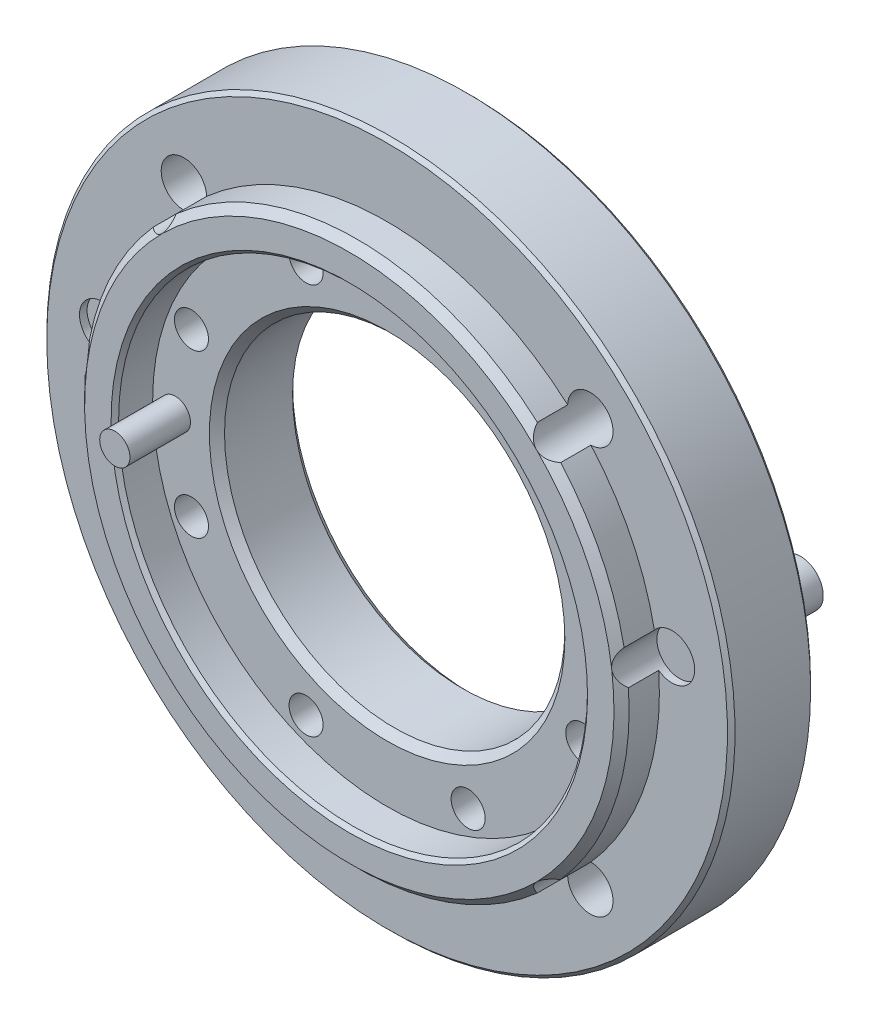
ISO-10303-21;
HEADER;
FILE_DESCRIPTION(('STEP AP214'),'2;1');
FILE_NAME('part.step','',(''),(''),'','','');
FILE_SCHEMA(('AUTOMOTIVE_DESIGN { 1 0 10303 214 1 1 1 1 }'));
ENDSEC;
DATA;
#1=APPLICATION_CONTEXT('core data for automotive mechanical design processes');
#2=APPLICATION_PROTOCOL_DEFINITION('international standard','automotive_design',2000,#1);
#3=PRODUCT_CONTEXT('',#1,'mechanical');
#4=PRODUCT('Part','Part','',(#3));
#5=PRODUCT_RELATED_PRODUCT_CATEGORY('part','',(#4));
#6=PRODUCT_DEFINITION_FORMATION('','',#4);
#7=PRODUCT_DEFINITION_CONTEXT('part definition',#1,'design');
#8=PRODUCT_DEFINITION('design','',#6,#7);
#9=PRODUCT_DEFINITION_SHAPE('','',#8);
#10=(LENGTH_UNIT() NAMED_UNIT(*) SI_UNIT(.MILLI.,.METRE.));
#11=(NAMED_UNIT(*) PLANE_ANGLE_UNIT() SI_UNIT($,.RADIAN.));
#12=(NAMED_UNIT(*) SI_UNIT($,.STERADIAN.) SOLID_ANGLE_UNIT());
#13=UNCERTAINTY_MEASURE_WITH_UNIT(LENGTH_MEASURE(1.E-05),#10,'distance_accuracy_value','');
#14=(GEOMETRIC_REPRESENTATION_CONTEXT(3) GLOBAL_UNCERTAINTY_ASSIGNED_CONTEXT((#13)) GLOBAL_UNIT_ASSIGNED_CONTEXT((#10,
#11,#12)) REPRESENTATION_CONTEXT('',''));
#15=CARTESIAN_POINT('',(0.,0.,0.));
#16=DIRECTION('',(0.,0.,1.));
#17=DIRECTION('',(1.,0.,0.));
#18=AXIS2_PLACEMENT_3D('',#15,#16,#17);
#19=CARTESIAN_POINT('',(0.,0.,15.));
#20=DIRECTION('',(0.,0.,-1.));
#21=DIRECTION('',(-1.,0.,0.));
#22=AXIS2_PLACEMENT_3D('',#19,#20,#21);
#23=CONICAL_SURFACE('',#22,36.,0.785398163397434);
#24=CARTESIAN_POINT('',(-27.173758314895,23.885469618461,14.8208789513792));
#25=CARTESIAN_POINT('',(-27.0968742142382,23.8776570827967,14.8837809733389));
#26=CARTESIAN_POINT('',(-27.0187796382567,23.8727025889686,14.9456269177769));
#27=CARTESIAN_POINT('',(-26.860224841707,23.8690205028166,15.0667404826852));
#28=CARTESIAN_POINT('',(-26.7797600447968,23.8703058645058,15.1260024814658));
#29=CARTESIAN_POINT('',(-26.6158790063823,23.8797062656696,15.2418962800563));
#30=CARTESIAN_POINT('',(-26.5324391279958,23.8879018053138,15.298488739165));
#31=CARTESIAN_POINT('',(-26.3639859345,23.9118274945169,15.4074308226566));
#32=CARTESIAN_POINT('',(-26.2789740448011,23.9275511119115,15.4597840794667));
#33=CARTESIAN_POINT('',(-26.0716859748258,23.9755460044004,15.5803865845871));
#34=CARTESIAN_POINT('',(-25.9488020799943,24.0119982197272,15.6460382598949));
#35=CARTESIAN_POINT('',(-25.7036001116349,24.1030434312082,15.7633966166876));
#36=CARTESIAN_POINT('',(-25.5812818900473,24.1575572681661,15.8151623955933));
#37=CARTESIAN_POINT('',(-25.359456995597,24.2755859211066,15.894526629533));
#38=CARTESIAN_POINT('',(-25.2593920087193,24.3363303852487,15.9246474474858));
#39=CARTESIAN_POINT('',(-25.0648947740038,24.4710256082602,15.9704893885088));
#40=CARTESIAN_POINT('',(-24.9704623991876,24.5449760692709,15.986210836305));
#41=CARTESIAN_POINT('',(-24.7902086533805,24.7047024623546,16.0019671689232));
#42=CARTESIAN_POINT('',(-24.7044121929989,24.7905110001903,16.0019579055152));
#43=CARTESIAN_POINT('',(-24.544479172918,24.9710484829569,15.9861423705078));
#44=CARTESIAN_POINT('',(-24.4703439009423,25.0657784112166,15.9703343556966));
#45=CARTESIAN_POINT('',(-24.3383139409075,25.2566255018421,15.9252478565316));
#46=CARTESIAN_POINT('',(-24.2798510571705,25.3525010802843,15.8965883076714));
#47=CARTESIAN_POINT('',(-24.1753835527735,25.5468335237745,15.8278681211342));
#48=CARTESIAN_POINT('',(-24.1293822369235,25.6452910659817,15.7878044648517));
#49=CARTESIAN_POINT('',(-24.0312729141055,25.8875740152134,15.6779276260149));
#50=CARTESIAN_POINT('',(-23.9858557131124,26.0317254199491,15.602862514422));
#51=CARTESIAN_POINT('',(-23.9177421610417,26.3173241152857,15.4381516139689));
#52=CARTESIAN_POINT('',(-23.895122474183,26.4587607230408,15.3484577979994));
#53=CARTESIAN_POINT('',(-23.8733922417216,26.6969399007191,15.1857555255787));
#54=CARTESIAN_POINT('',(-23.8694388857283,26.7949990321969,15.1152127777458));
#55=CARTESIAN_POINT('',(-23.8708239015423,26.9871898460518,14.9705568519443));
#56=CARTESIAN_POINT('',(-23.8760891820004,27.0813464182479,14.8964762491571));
#57=CARTESIAN_POINT('',(-23.8854696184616,27.1737583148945,14.8208789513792));
#58=B_SPLINE_CURVE_WITH_KNOTS('',3,(#24,#25,#26,#27,#28,#29,#30,#31,#32,#33,#34,#35,#36,#37,#38,
#39,#40,#41,#42,#43,#44,#45,#46,#47,#48,#49,#50,#51,#52,#53,#54,#55,#56,#57),.UNSPECIFIED.,.F.,
.F.,(4,2,2,2,2,2,2,2,2,2,2,2,2,2,2,2,4),(0.,0.298940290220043,0.59850144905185,
0.901601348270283,1.20443872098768,1.63488488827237,2.06346894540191,2.42454423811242,
2.78561138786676,3.14769187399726,3.5098123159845,3.85610595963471,4.2024913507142,
4.70595722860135,5.21111058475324,5.57324364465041,5.9325184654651),.UNSPECIFIED.);
#59=CARTESIAN_POINT('',(-26.9475881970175,23.8710596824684,15.));
#60=VERTEX_POINT('',#59);
#61=CARTESIAN_POINT('',(-24.7487373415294,24.748737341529,16.));
#62=VERTEX_POINT('',#61);
#63=EDGE_CURVE('E239',#60,#62,#58,.T.);
#64=ORIENTED_EDGE('',*,*,#63,.F.);
#65=CARTESIAN_POINT('',(0.,0.,15.));
#66=DIRECTION('',(0.,0.,-1.));
#67=DIRECTION('',(-1.,0.,0.));
#68=AXIS2_PLACEMENT_3D('',#65,#66,#67);
#69=CIRCLE('',#68,36.);
#70=CARTESIAN_POINT('',(-35.3355461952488,6.88470588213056,14.9999999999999));
#71=VERTEX_POINT('',#70);
#72=EDGE_CURVE('E284',#60,#71,#69,.F.);
#73=ORIENTED_EDGE('',*,*,#72,.T.);
#74=CARTESIAN_POINT('',(-35.3355461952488,6.88470588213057,14.9999999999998));
#75=CARTESIAN_POINT('',(-35.2902988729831,6.8286462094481,15.0551313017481));
#76=CARTESIAN_POINT('',(-35.2465355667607,6.77033838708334,15.109150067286));
#77=CARTESIAN_POINT('',(-35.1623232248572,6.64893232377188,15.2146040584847));
#78=CARTESIAN_POINT('',(-35.1218806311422,6.58582520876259,15.266034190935));
#79=CARTESIAN_POINT('',(-35.0054612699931,6.38775692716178,15.4166856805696));
#80=CARTESIAN_POINT('',(-34.9354066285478,6.2452709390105,15.5110360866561));
#81=CARTESIAN_POINT('',(-34.8315835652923,5.97999787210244,15.6589643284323));
#82=CARTESIAN_POINT('',(-34.7931178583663,5.86141792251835,15.7168088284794));
#83=CARTESIAN_POINT('',(-34.7306873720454,5.61533647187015,15.8184809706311));
#84=CARTESIAN_POINT('',(-34.7066403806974,5.48789026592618,15.8623873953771));
#85=CARTESIAN_POINT('',(-34.6839487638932,5.29879267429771,15.9136740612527));
#86=CARTESIAN_POINT('',(-34.6786096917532,5.23968479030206,15.9278336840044));
#87=CARTESIAN_POINT('',(-34.671442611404,5.12047751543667,15.9525348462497));
#88=CARTESIAN_POINT('',(-34.6696152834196,5.06037793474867,15.96307568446));
#89=CARTESIAN_POINT('',(-34.6696176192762,4.93448323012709,15.9810434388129));
#90=CARTESIAN_POINT('',(-34.6717717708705,4.86863870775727,15.9881289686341));
#91=CARTESIAN_POINT('',(-34.6804445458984,4.73685706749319,15.9976192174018));
#92=CARTESIAN_POINT('',(-34.686966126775,4.67091991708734,16.0000207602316));
#93=CARTESIAN_POINT('',(-34.6956993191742,4.60526315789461,16.));
#94=B_SPLINE_CURVE_WITH_KNOTS('',3,(#74,#75,#76,#77,#78,#79,#80,#81,#82,#83,#84,#85,#86,#87,#88,
#89,#90,#91,#92,#93),.UNSPECIFIED.,.F.,.F.,(4,2,2,2,2,2,2,2,2,4),(0.,0.272027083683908,
0.544569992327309,1.09563098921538,1.50653411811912,1.9150715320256,2.09793891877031,
2.28084172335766,2.47931159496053,2.67791599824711),.UNSPECIFIED.);
#95=CARTESIAN_POINT('',(-34.6956993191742,4.6052631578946,16.));
#96=VERTEX_POINT('',#95);
#97=EDGE_CURVE('E152',#71,#96,#94,.T.);
#98=ORIENTED_EDGE('',*,*,#97,.T.);
#99=CARTESIAN_POINT('',(0.,0.,16.));
#100=DIRECTION('',(0.,0.,-1.));
#101=DIRECTION('',(-1.,0.,0.));
#102=AXIS2_PLACEMENT_3D('',#99,#100,#101);
#103=CIRCLE('',#102,35.);
#104=EDGE_CURVE('E196',#96,#62,#103,.T.);
#105=ORIENTED_EDGE('',*,*,#104,.T.);
#106=EDGE_LOOP('',(#64,#73,#98,#105));
#107=FACE_BOUND('',#106,.T.);
#108=ADVANCED_FACE('F17',(#107),#23,.T.);
#109=CARTESIAN_POINT('',(-23.8710596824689,26.9475881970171,15.));
#110=VERTEX_POINT('',#109);
#111=EDGE_CURVE('E243',#62,#110,#58,.T.);
#112=ORIENTED_EDGE('',*,*,#111,.F.);
#113=CARTESIAN_POINT('',(24.748737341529,24.7487373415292,16.0000000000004));
#114=VERTEX_POINT('',#113);
#115=EDGE_CURVE('E200',#62,#114,#103,.T.);
#116=ORIENTED_EDGE('',*,*,#115,.T.);
#117=CARTESIAN_POINT('',(23.8854696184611,27.173758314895,14.8208789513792));
#118=CARTESIAN_POINT('',(23.8776570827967,27.0968742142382,14.8837809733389));
#119=CARTESIAN_POINT('',(23.8727025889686,27.0187796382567,14.9456269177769));
#120=CARTESIAN_POINT('',(23.8690205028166,26.8602248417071,15.0667404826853));
#121=CARTESIAN_POINT('',(23.8703058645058,26.7797600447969,15.1260024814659));
#122=CARTESIAN_POINT('',(23.8797062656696,26.6158790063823,15.2418962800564));
#123=CARTESIAN_POINT('',(23.8879018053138,26.5324391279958,15.298488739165));
#124=CARTESIAN_POINT('',(23.9118274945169,26.3639859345,15.4074308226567));
#125=CARTESIAN_POINT('',(23.9275511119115,26.2789740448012,15.4597840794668));
#126=CARTESIAN_POINT('',(23.9755460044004,26.0716859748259,15.5803865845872));
#127=CARTESIAN_POINT('',(24.0119982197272,25.9488020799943,15.646038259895));
#128=CARTESIAN_POINT('',(24.1030434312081,25.7036001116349,15.7633966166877));
#129=CARTESIAN_POINT('',(24.1575572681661,25.5812818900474,15.8151623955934));
#130=CARTESIAN_POINT('',(24.2755859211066,25.3594569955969,15.8945266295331));
#131=CARTESIAN_POINT('',(24.3363303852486,25.2593920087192,15.924647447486));
#132=CARTESIAN_POINT('',(24.4710256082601,25.0648947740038,15.970489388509));
#133=CARTESIAN_POINT('',(24.5449760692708,24.9704623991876,15.9862108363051));
#134=CARTESIAN_POINT('',(24.7047024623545,24.7902086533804,16.0019671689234));
#135=CARTESIAN_POINT('',(24.7905110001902,24.7044121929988,16.0019579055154));
#136=CARTESIAN_POINT('',(24.9710484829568,24.5444791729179,15.986142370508));
#137=CARTESIAN_POINT('',(25.0657784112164,24.4703439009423,15.9703343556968));
#138=CARTESIAN_POINT('',(25.256625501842,24.3383139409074,15.9252478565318));
#139=CARTESIAN_POINT('',(25.3525010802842,24.2798510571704,15.8965883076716));
#140=CARTESIAN_POINT('',(25.5468335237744,24.1753835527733,15.8278681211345));
#141=CARTESIAN_POINT('',(25.6452910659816,24.1293822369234,15.7878044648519));
#142=CARTESIAN_POINT('',(25.8875740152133,24.0312729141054,15.6779276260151));
#143=CARTESIAN_POINT('',(26.031725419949,23.9858557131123,15.6028625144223));
#144=CARTESIAN_POINT('',(26.3173241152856,23.9177421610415,15.4381516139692));
#145=CARTESIAN_POINT('',(26.4587607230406,23.8951224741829,15.3484577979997));
#146=CARTESIAN_POINT('',(26.696939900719,23.8733922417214,15.1857555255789));
#147=CARTESIAN_POINT('',(26.7949990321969,23.8694388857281,15.1152127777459));
#148=CARTESIAN_POINT('',(26.987189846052,23.8708239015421,14.9705568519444));
#149=CARTESIAN_POINT('',(27.0813464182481,23.8760891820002,14.8964762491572));
#150=CARTESIAN_POINT('',(27.1737583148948,23.8854696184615,14.8208789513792));
#151=B_SPLINE_CURVE_WITH_KNOTS('',3,(#117,#118,#119,#120,#121,#122,#123,#124,#125,#126,#127,
#128,#129,#130,#131,#132,#133,#134,#135,#136,#137,#138,#139,#140,#141,#142,#143,#144,#145,#146,
#147,#148,#149,#150),.UNSPECIFIED.,.F.,.F.,(4,2,2,2,2,2,2,2,2,2,2,2,2,2,2,2,4),(0.,
0.298940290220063,0.598501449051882,0.901601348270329,1.20443872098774,1.63488488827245,
2.06346894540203,2.42454423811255,2.78561138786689,3.14769187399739,3.50981231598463,
3.85610595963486,4.20249135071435,4.70595722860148,5.21111058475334,5.57324364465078,
5.93251846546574),.UNSPECIFIED.);
#152=CARTESIAN_POINT('',(23.8710596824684,26.9475881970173,15.));
#153=VERTEX_POINT('',#152);
#154=EDGE_CURVE('E384',#153,#114,#151,.T.);
#155=ORIENTED_EDGE('',*,*,#154,.F.);
#156=CARTESIAN_POINT('',(0.,0.,15.));
#157=DIRECTION('',(0.,0.,-1.));
#158=DIRECTION('',(-1.,0.,0.));
#159=AXIS2_PLACEMENT_3D('',#156,#157,#158);
#160=CIRCLE('',#159,36.);
#161=EDGE_CURVE('E280',#110,#153,#160,.T.);
#162=ORIENTED_EDGE('',*,*,#161,.F.);
#163=EDGE_LOOP('',(#112,#116,#155,#162));
#164=FACE_BOUND('',#163,.T.);
#165=ADVANCED_FACE('F372',(#164),#23,.T.);
#166=CARTESIAN_POINT('',(0.,0.,15.));
#167=DIRECTION('',(0.,0.,-1.));
#168=DIRECTION('',(-1.,0.,0.));
#169=AXIS2_PLACEMENT_3D('',#166,#167,#168);
#170=CONICAL_SURFACE('',#169,36.,0.785398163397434);
#171=CARTESIAN_POINT('',(-23.8861722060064,-27.1805853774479,14.8152871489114));
#172=CARTESIAN_POINT('',(-23.878166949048,-27.1035563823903,14.8784301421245));
#173=CARTESIAN_POINT('',(-23.8730292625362,-27.0253081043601,14.9405179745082));
#174=CARTESIAN_POINT('',(-23.8690021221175,-26.8664272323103,15.0621161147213));
#175=CARTESIAN_POINT('',(-23.8701257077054,-26.7857900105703,15.1216207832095));
#176=CARTESIAN_POINT('',(-23.8792254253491,-26.6215422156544,15.2380018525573));
#177=CARTESIAN_POINT('',(-23.8872824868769,-26.53790774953,15.2948388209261));
#178=CARTESIAN_POINT('',(-23.9109608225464,-26.3690471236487,15.4042640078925));
#179=CARTESIAN_POINT('',(-23.9265755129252,-26.2838224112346,15.4568558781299));
#180=CARTESIAN_POINT('',(-23.9743011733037,-26.0762021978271,15.5779045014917));
#181=CARTESIAN_POINT('',(-24.0105827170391,-25.9531939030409,15.6437758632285));
#182=CARTESIAN_POINT('',(-24.1013113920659,-25.7077086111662,15.7615840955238));
#183=CARTESIAN_POINT('',(-24.1556792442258,-25.5852316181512,15.8135800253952));
#184=CARTESIAN_POINT('',(-24.2734523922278,-25.3631249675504,15.8933519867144));
#185=CARTESIAN_POINT('',(-24.3340753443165,-25.2629412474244,15.9236558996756));
#186=CARTESIAN_POINT('',(-24.4685567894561,-25.0681773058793,15.9698650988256));
#187=CARTESIAN_POINT('',(-24.5424149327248,-24.9735969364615,15.985770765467));
#188=CARTESIAN_POINT('',(-24.7020009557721,-24.7930204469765,16.0018824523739));
#189=CARTESIAN_POINT('',(-24.7877620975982,-24.7070495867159,16.002043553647));
#190=CARTESIAN_POINT('',(-24.9682500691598,-24.5467619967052,15.986538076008));
#191=CARTESIAN_POINT('',(-25.0629778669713,-24.4724465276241,15.9708697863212));
#192=CARTESIAN_POINT('',(-25.2537705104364,-24.3401355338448,15.9260396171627));
#193=CARTESIAN_POINT('',(-25.3495872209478,-24.2815598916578,15.8975108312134));
#194=CARTESIAN_POINT('',(-25.5438236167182,-24.1768632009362,15.8290373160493));
#195=CARTESIAN_POINT('',(-25.6422439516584,-24.1307452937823,15.7890897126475));
#196=CARTESIAN_POINT('',(-25.8842908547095,-24.0324197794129,15.6795532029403));
#197=CARTESIAN_POINT('',(-26.0282519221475,-23.9868744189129,15.6047265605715));
#198=CARTESIAN_POINT('',(-26.3135111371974,-23.9184649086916,15.4404871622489));
#199=CARTESIAN_POINT('',(-26.454798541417,-23.8956785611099,15.3510255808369));
#200=CARTESIAN_POINT('',(-26.6947948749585,-23.8734504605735,15.1873188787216));
#201=CARTESIAN_POINT('',(-26.7947546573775,-23.8693848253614,15.1154334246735));
#202=CARTESIAN_POINT('',(-26.9905934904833,-23.8709009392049,14.9679582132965));
#203=CARTESIAN_POINT('',(-27.086498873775,-23.8764054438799,14.8924028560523));
#204=CARTESIAN_POINT('',(-27.1805853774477,-23.8861722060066,14.8152871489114));
#205=B_SPLINE_CURVE_WITH_KNOTS('',3,(#171,#172,#173,#174,#175,#176,#177,#178,#179,#180,#181,
#182,#183,#184,#185,#186,#187,#188,#189,#190,#191,#192,#193,#194,#195,#196,#197,#198,#199,#200,
#201,#202,#203,#204),.UNSPECIFIED.,.F.,.F.,(4,2,2,2,2,2,2,2,2,2,2,2,2,2,2,2,4),(0.,
0.299777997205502,0.600180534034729,0.904137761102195,1.2078306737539,1.63876764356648,
2.06784001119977,2.4291649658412,2.79048037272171,3.15282657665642,3.51521194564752,
3.86143218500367,4.20773964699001,4.71050722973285,5.21498771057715,5.58407976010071,
5.950206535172),.UNSPECIFIED.);
#206=CARTESIAN_POINT('',(-23.8710596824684,-26.9475881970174,15.));
#207=VERTEX_POINT('',#206);
#208=CARTESIAN_POINT('',(-24.7487373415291,-24.7487373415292,16.));
#209=VERTEX_POINT('',#208);
#210=EDGE_CURVE('E515',#207,#209,#205,.T.);
#211=ORIENTED_EDGE('',*,*,#210,.F.);
#212=CARTESIAN_POINT('',(0.,0.,15.));
#213=DIRECTION('',(0.,0.,-1.));
#214=DIRECTION('',(-1.,0.,0.));
#215=AXIS2_PLACEMENT_3D('',#212,#213,#214);
#216=CIRCLE('',#215,36.);
#217=CARTESIAN_POINT('',(23.8710596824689,-26.9475881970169,15.));
#218=VERTEX_POINT('',#217);
#219=EDGE_CURVE('E264',#218,#207,#216,.T.);
#220=ORIENTED_EDGE('',*,*,#219,.F.);
#221=CARTESIAN_POINT('',(27.1805853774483,-23.8861722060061,14.8152871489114));
#222=CARTESIAN_POINT('',(27.1035563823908,-23.8781669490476,14.8784301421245));
#223=CARTESIAN_POINT('',(27.0253081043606,-23.8730292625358,14.9405179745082));
#224=CARTESIAN_POINT('',(26.8664272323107,-23.8690021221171,15.0621161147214));
#225=CARTESIAN_POINT('',(26.7857900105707,-23.8701257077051,15.1216207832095));
#226=CARTESIAN_POINT('',(26.6215422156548,-23.8792254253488,15.2380018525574));
#227=CARTESIAN_POINT('',(26.5379077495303,-23.8872824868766,15.2948388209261));
#228=CARTESIAN_POINT('',(26.3690471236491,-23.910960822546,15.4042640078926));
#229=CARTESIAN_POINT('',(26.2838224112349,-23.9265755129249,15.45685587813));
#230=CARTESIAN_POINT('',(26.0762021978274,-23.9743011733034,15.5779045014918));
#231=CARTESIAN_POINT('',(25.9531939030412,-24.0105827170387,15.6437758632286));
#232=CARTESIAN_POINT('',(25.7077086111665,-24.1013113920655,15.7615840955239));
#233=CARTESIAN_POINT('',(25.5852316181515,-24.1556792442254,15.8135800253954));
#234=CARTESIAN_POINT('',(25.3631249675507,-24.2734523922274,15.8933519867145));
#235=CARTESIAN_POINT('',(25.2629412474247,-24.3340753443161,15.9236558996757));
#236=CARTESIAN_POINT('',(25.0681773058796,-24.4685567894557,15.9698650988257));
#237=CARTESIAN_POINT('',(24.9735969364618,-24.5424149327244,15.9857707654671));
#238=CARTESIAN_POINT('',(24.7930204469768,-24.7020009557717,16.0018824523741));
#239=CARTESIAN_POINT('',(24.7070495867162,-24.7877620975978,16.0020435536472));
#240=CARTESIAN_POINT('',(24.5467619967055,-24.9682500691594,15.9865380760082));
#241=CARTESIAN_POINT('',(24.4724465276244,-25.0629778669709,15.9708697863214));
#242=CARTESIAN_POINT('',(24.3401355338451,-25.253770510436,15.9260396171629));
#243=CARTESIAN_POINT('',(24.281559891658,-25.3495872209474,15.8975108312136));
#244=CARTESIAN_POINT('',(24.1768632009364,-25.5438236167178,15.8290373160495));
#245=CARTESIAN_POINT('',(24.1307452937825,-25.642243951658,15.7890897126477));
#246=CARTESIAN_POINT('',(24.0324197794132,-25.8842908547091,15.6795532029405));
#247=CARTESIAN_POINT('',(23.9868744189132,-26.0282519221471,15.6047265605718));
#248=CARTESIAN_POINT('',(23.9184649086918,-26.3135111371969,15.4404871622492));
#249=CARTESIAN_POINT('',(23.8956785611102,-26.4547985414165,15.3510255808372));
#250=CARTESIAN_POINT('',(23.8734504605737,-26.6947948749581,15.1873188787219));
#251=CARTESIAN_POINT('',(23.8693848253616,-26.7947546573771,15.1154334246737));
#252=CARTESIAN_POINT('',(23.8709009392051,-26.9905934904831,14.9679582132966));
#253=CARTESIAN_POINT('',(23.8764054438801,-27.0864988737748,14.8924028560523));
#254=CARTESIAN_POINT('',(23.8861722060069,-27.1805853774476,14.8152871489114));
#255=B_SPLINE_CURVE_WITH_KNOTS('',3,(#221,#222,#223,#224,#225,#226,#227,#228,#229,#230,#231,
#232,#233,#234,#235,#236,#237,#238,#239,#240,#241,#242,#243,#244,#245,#246,#247,#248,#249,#250,
#251,#252,#253,#254),.UNSPECIFIED.,.F.,.F.,(4,2,2,2,2,2,2,2,2,2,2,2,2,2,2,2,4),(0.,
0.299777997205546,0.60018053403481,0.904137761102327,1.20783067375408,1.63876764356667,
2.06784001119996,2.42916496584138,2.7904803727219,3.15282657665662,3.51521194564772,
3.86143218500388,4.20773964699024,4.71050722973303,5.21498771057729,5.58407976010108,
5.95020653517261),.UNSPECIFIED.);
#256=CARTESIAN_POINT('',(24.7487373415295,-24.7487373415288,16.0000000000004));
#257=VERTEX_POINT('',#256);
#258=EDGE_CURVE('E516',#257,#218,#255,.T.);
#259=ORIENTED_EDGE('',*,*,#258,.F.);
#260=CARTESIAN_POINT('',(0.,0.,16.));
#261=DIRECTION('',(0.,0.,-1.));
#262=DIRECTION('',(-1.,0.,0.));
#263=AXIS2_PLACEMENT_3D('',#260,#261,#262);
#264=CIRCLE('',#263,35.);
#265=EDGE_CURVE('E491',#257,#209,#264,.T.);
#266=ORIENTED_EDGE('',*,*,#265,.T.);
#267=EDGE_LOOP('',(#211,#220,#259,#266));
#268=FACE_BOUND('',#267,.T.);
#269=ADVANCED_FACE('F460',(#268),#170,.T.);
#270=CARTESIAN_POINT('',(26.9475881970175,-23.8710596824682,15.));
#271=VERTEX_POINT('',#270);
#272=EDGE_CURVE('E495',#271,#257,#255,.T.);
#273=ORIENTED_EDGE('',*,*,#272,.F.);
#274=CARTESIAN_POINT('',(0.,0.,15.));
#275=DIRECTION('',(0.,0.,-1.));
#276=DIRECTION('',(-1.,0.,0.));
#277=AXIS2_PLACEMENT_3D('',#274,#275,#276);
#278=CIRCLE('',#277,36.);
#279=CARTESIAN_POINT('',(35.90802887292,2.57166530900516,15.));
#280=VERTEX_POINT('',#279);
#281=EDGE_CURVE('E21',#271,#280,#278,.F.);
#282=ORIENTED_EDGE('',*,*,#281,.T.);
#283=CARTESIAN_POINT('',(35.90802887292,2.57166530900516,15.));
#284=CARTESIAN_POINT('',(35.8497676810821,2.61394838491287,15.0550900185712));
#285=CARTESIAN_POINT('',(35.7923513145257,2.65878527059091,15.1090692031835));
#286=CARTESIAN_POINT('',(35.6794671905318,2.75393811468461,15.2144464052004));
#287=CARTESIAN_POINT('',(35.6240032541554,2.80426410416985,15.2658394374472));
#288=CARTESIAN_POINT('',(35.4598933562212,2.96511671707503,15.4165426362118));
#289=CARTESIAN_POINT('',(35.3550100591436,3.08447351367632,15.5109707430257));
#290=CARTESIAN_POINT('',(35.184739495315,3.31461340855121,15.6596330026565));
#291=CARTESIAN_POINT('',(35.1159959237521,3.42023077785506,15.7180338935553));
#292=CARTESIAN_POINT('',(34.990586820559,3.64389190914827,15.8203824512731));
#293=CARTESIAN_POINT('',(34.9338312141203,3.76183225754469,15.8644393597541));
#294=CARTESIAN_POINT('',(34.8620243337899,3.94118036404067,15.9159547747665));
#295=CARTESIAN_POINT('',(34.8411007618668,3.99837169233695,15.9302741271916));
#296=CARTESIAN_POINT('',(34.8025708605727,4.11467764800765,15.9550871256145));
#297=CARTESIAN_POINT('',(34.7849638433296,4.17379187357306,15.965581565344));
#298=CARTESIAN_POINT('',(34.7531146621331,4.294343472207,15.9826256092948));
#299=CARTESIAN_POINT('',(34.7389206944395,4.35580135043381,15.9891205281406));
#300=CARTESIAN_POINT('',(34.7143752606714,4.47983297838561,15.9978181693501));
#301=CARTESIAN_POINT('',(34.7040271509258,4.54240765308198,16.0000171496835));
#302=CARTESIAN_POINT('',(34.695699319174,4.60526315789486,16.));
#303=B_SPLINE_CURVE_WITH_KNOTS('',3,(#283,#284,#285,#286,#287,#288,#289,#290,#291,#292,#293,
#294,#295,#296,#297,#298,#299,#300,#301,#302),.UNSPECIFIED.,.F.,.F.,(4,2,2,2,2,2,2,2,2,4),(0.,
0.271823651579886,0.544152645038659,1.09562984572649,1.51087473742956,1.92287889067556,
2.11036675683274,2.29781569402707,2.48777379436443,2.67789728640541),.UNSPECIFIED.);
#304=CARTESIAN_POINT('',(34.695699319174,4.60526315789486,16.));
#305=VERTEX_POINT('',#304);
#306=EDGE_CURVE('E149',#280,#305,#303,.T.);
#307=ORIENTED_EDGE('',*,*,#306,.T.);
#308=EDGE_CURVE('E271',#305,#257,#264,.T.);
#309=ORIENTED_EDGE('',*,*,#308,.T.);
#310=EDGE_LOOP('',(#273,#282,#307,#309));
#311=FACE_BOUND('',#310,.T.);
#312=ADVANCED_FACE('F409',(#311),#170,.T.);
#313=CARTESIAN_POINT('',(0.,0.,16.));
#314=DIRECTION('',(0.,0.,-1.));
#315=DIRECTION('',(-1.,0.,0.));
#316=AXIS2_PLACEMENT_3D('',#313,#314,#315);
#317=CYLINDRICAL_SURFACE('',#316,31.);
#318=CARTESIAN_POINT('',(0.,0.,15.5));
#319=DIRECTION('',(0.,0.,1.));
#320=DIRECTION('',(1.,0.,0.));
#321=AXIS2_PLACEMENT_3D('',#318,#319,#320);
#322=CIRCLE('',#321,31.);
#323=CARTESIAN_POINT('',(30.9999999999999,1.08235921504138E-13,15.5000000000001));
#324=VERTEX_POINT('',#323);
#325=EDGE_CURVE('E231',#324,#324,#322,.T.);
#326=ORIENTED_EDGE('',*,*,#325,.T.);
#327=EDGE_LOOP('',(#326));
#328=FACE_BOUND('',#327,.T.);
#329=CARTESIAN_POINT('',(0.,0.,11.));
#330=DIRECTION('',(0.,0.,-1.));
#331=DIRECTION('',(-1.,0.,0.));
#332=AXIS2_PLACEMENT_3D('',#329,#330,#331);
#333=CIRCLE('',#332,31.);
#334=CARTESIAN_POINT('',(-31.,-1.08235921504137E-13,10.9999999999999));
#335=VERTEX_POINT('',#334);
#336=EDGE_CURVE('E232',#335,#335,#333,.F.);
#337=ORIENTED_EDGE('',*,*,#336,.F.);
#338=EDGE_LOOP('',(#337));
#339=FACE_BOUND('',#338,.T.);
#340=ADVANCED_FACE('F19',(#328,#339),#317,.F.);
#341=CARTESIAN_POINT('',(0.,0.,11.));
#342=DIRECTION('',(0.,0.,1.));
#343=DIRECTION('',(1.,0.,0.));
#344=AXIS2_PLACEMENT_3D('',#341,#342,#343);
#345=PLANE('',#344);
#346=ORIENTED_EDGE('',*,*,#336,.T.);
#347=EDGE_LOOP('',(#346));
#348=FACE_BOUND('',#347,.T.);
#349=CARTESIAN_POINT('',(25.8686269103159,10.7151361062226,11.));
#350=DIRECTION('',(0.,0.,-1.));
#351=DIRECTION('',(-1.,0.,0.));
#352=AXIS2_PLACEMENT_3D('',#349,#350,#351);
#353=CIRCLE('',#352,2.25);
#354=CARTESIAN_POINT('',(23.6186269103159,10.7151361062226,11.));
#355=VERTEX_POINT('',#354);
#356=EDGE_CURVE('E205',#355,#355,#353,.T.);
#357=ORIENTED_EDGE('',*,*,#356,.T.);
#358=EDGE_LOOP('',(#357));
#359=FACE_BOUND('',#358,.T.);
#360=CARTESIAN_POINT('',(10.7151361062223,25.8686269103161,11.));
#361=DIRECTION('',(0.,0.,-1.));
#362=DIRECTION('',(-1.,0.,0.));
#363=AXIS2_PLACEMENT_3D('',#360,#361,#362);
#364=CIRCLE('',#363,2.25);
#365=CARTESIAN_POINT('',(8.4651361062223,25.8686269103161,11.));
#366=VERTEX_POINT('',#365);
#367=EDGE_CURVE('E208',#366,#366,#364,.T.);
#368=ORIENTED_EDGE('',*,*,#367,.T.);
#369=EDGE_LOOP('',(#368));
#370=FACE_BOUND('',#369,.T.);
#371=CARTESIAN_POINT('',(-10.7151361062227,25.8686269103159,11.));
#372=DIRECTION('',(0.,0.,-1.));
#373=DIRECTION('',(-1.,0.,0.));
#374=AXIS2_PLACEMENT_3D('',#371,#372,#373);
#375=CIRCLE('',#374,2.25);
#376=CARTESIAN_POINT('',(-12.9651361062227,25.8686269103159,11.));
#377=VERTEX_POINT('',#376);
#378=EDGE_CURVE('E211',#377,#377,#375,.T.);
#379=ORIENTED_EDGE('',*,*,#378,.T.);
#380=EDGE_LOOP('',(#379));
#381=FACE_BOUND('',#380,.T.);
#382=CARTESIAN_POINT('',(-25.8686269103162,10.7151361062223,11.));
#383=DIRECTION('',(0.,0.,-1.));
#384=DIRECTION('',(-1.,0.,0.));
#385=AXIS2_PLACEMENT_3D('',#382,#383,#384);
#386=CIRCLE('',#385,2.25);
#387=CARTESIAN_POINT('',(-28.1186269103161,10.7151361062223,11.));
#388=VERTEX_POINT('',#387);
#389=EDGE_CURVE('E214',#388,#388,#386,.T.);
#390=ORIENTED_EDGE('',*,*,#389,.T.);
#391=EDGE_LOOP('',(#390));
#392=FACE_BOUND('',#391,.T.);
#393=CARTESIAN_POINT('',(-25.868626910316,-10.7151361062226,11.));
#394=DIRECTION('',(0.,0.,-1.));
#395=DIRECTION('',(-1.,0.,0.));
#396=AXIS2_PLACEMENT_3D('',#393,#394,#395);
#397=CIRCLE('',#396,2.25);
#398=CARTESIAN_POINT('',(-28.118626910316,-10.7151361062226,11.));
#399=VERTEX_POINT('',#398);
#400=EDGE_CURVE('E217',#399,#399,#397,.T.);
#401=ORIENTED_EDGE('',*,*,#400,.T.);
#402=EDGE_LOOP('',(#401));
#403=FACE_BOUND('',#402,.T.);
#404=CARTESIAN_POINT('',(-10.7151361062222,-25.8686269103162,11.));
#405=DIRECTION('',(0.,0.,-1.));
#406=DIRECTION('',(-1.,0.,0.));
#407=AXIS2_PLACEMENT_3D('',#404,#405,#406);
#408=CIRCLE('',#407,2.25);
#409=CARTESIAN_POINT('',(-12.9651361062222,-25.8686269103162,11.));
#410=VERTEX_POINT('',#409);
#411=EDGE_CURVE('E220',#410,#410,#408,.T.);
#412=ORIENTED_EDGE('',*,*,#411,.T.);
#413=EDGE_LOOP('',(#412));
#414=FACE_BOUND('',#413,.T.);
#415=CARTESIAN_POINT('',(10.7151361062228,-25.8686269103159,11.));
#416=DIRECTION('',(0.,0.,-1.));
#417=DIRECTION('',(-1.,0.,0.));
#418=AXIS2_PLACEMENT_3D('',#415,#416,#417);
#419=CIRCLE('',#418,2.25);
#420=CARTESIAN_POINT('',(8.46513610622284,-25.8686269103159,11.));
#421=VERTEX_POINT('',#420);
#422=EDGE_CURVE('E223',#421,#421,#419,.T.);
#423=ORIENTED_EDGE('',*,*,#422,.T.);
#424=EDGE_LOOP('',(#423));
#425=FACE_BOUND('',#424,.T.);
#426=CARTESIAN_POINT('',(25.8686269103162,-10.7151361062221,11.));
#427=DIRECTION('',(0.,0.,-1.));
#428=DIRECTION('',(-1.,0.,0.));
#429=AXIS2_PLACEMENT_3D('',#426,#427,#428);
#430=CIRCLE('',#429,2.25);
#431=CARTESIAN_POINT('',(23.6186269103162,-10.7151361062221,11.));
#432=VERTEX_POINT('',#431);
#433=EDGE_CURVE('E226',#432,#432,#430,.T.);
#434=ORIENTED_EDGE('',*,*,#433,.T.);
#435=EDGE_LOOP('',(#434));
#436=FACE_BOUND('',#435,.T.);
#437=CARTESIAN_POINT('',(-28.,0.,11.));
#438=DIRECTION('',(0.,0.,1.));
#439=DIRECTION('',(-1.,0.,0.));
#440=AXIS2_PLACEMENT_3D('',#437,#438,#439);
#441=CIRCLE('',#440,2.);
#442=CARTESIAN_POINT('',(-30.,0.,11.));
#443=VERTEX_POINT('',#442);
#444=EDGE_CURVE('E572',#443,#443,#441,.F.);
#445=ORIENTED_EDGE('',*,*,#444,.T.);
#446=EDGE_LOOP('',(#445));
#447=FACE_BOUND('',#446,.T.);
#448=CARTESIAN_POINT('',(0.,0.,11.));
#449=DIRECTION('',(0.,0.,1.));
#450=DIRECTION('',(1.,0.,0.));
#451=AXIS2_PLACEMENT_3D('',#448,#449,#450);
#452=CIRCLE('',#451,23.5);
#453=CARTESIAN_POINT('',(23.5,0.,11.0000000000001));
#454=VERTEX_POINT('',#453);
#455=EDGE_CURVE('E229',#454,#454,#452,.F.);
#456=ORIENTED_EDGE('',*,*,#455,.T.);
#457=EDGE_LOOP('',(#456));
#458=FACE_BOUND('',#457,.T.);
#459=ADVANCED_FACE('F681',(#348,#359,#370,#381,#392,#403,#414,#425,#436,#447,#458),#345,.T.);
#460=CARTESIAN_POINT('',(0.,0.,16.));
#461=DIRECTION('',(0.,0.,1.));
#462=DIRECTION('',(0.,-1.,0.));
#463=AXIS2_PLACEMENT_3D('',#460,#461,#462);
#464=CONICAL_SURFACE('',#463,31.5,0.785398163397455);
#465=ORIENTED_EDGE('',*,*,#325,.F.);
#466=EDGE_LOOP('',(#465));
#467=FACE_BOUND('',#466,.T.);
#468=CARTESIAN_POINT('',(0.,0.,16.));
#469=DIRECTION('',(0.,0.,1.));
#470=DIRECTION('',(0.,-1.,0.));
#471=AXIS2_PLACEMENT_3D('',#468,#469,#470);
#472=CIRCLE('',#471,31.5);
#473=CARTESIAN_POINT('',(0.,-31.5,16.));
#474=VERTEX_POINT('',#473);
#475=EDGE_CURVE('E202',#474,#474,#472,.F.);
#476=ORIENTED_EDGE('',*,*,#475,.F.);
#477=EDGE_LOOP('',(#476));
#478=FACE_BOUND('',#477,.T.);
#479=ADVANCED_FACE('F684',(#467,#478),#464,.F.);
#480=CARTESIAN_POINT('',(0.,0.,11.));
#481=DIRECTION('',(0.,0.,1.));
#482=DIRECTION('',(1.,0.,0.));
#483=AXIS2_PLACEMENT_3D('',#480,#481,#482);
#484=CONICAL_SURFACE('',#483,23.5,0.785398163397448);
#485=ORIENTED_EDGE('',*,*,#455,.F.);
#486=EDGE_LOOP('',(#485));
#487=FACE_BOUND('',#486,.T.);
#488=CARTESIAN_POINT('',(0.,0.,10.));
#489=DIRECTION('',(0.,0.,1.));
#490=DIRECTION('',(1.,0.,0.));
#491=AXIS2_PLACEMENT_3D('',#488,#489,#490);
#492=CIRCLE('',#491,22.5);
#493=CARTESIAN_POINT('',(22.5,0.,10.0000000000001));
#494=VERTEX_POINT('',#493);
#495=EDGE_CURVE('E283',#494,#494,#492,.F.);
#496=ORIENTED_EDGE('',*,*,#495,.T.);
#497=EDGE_LOOP('',(#496));
#498=FACE_BOUND('',#497,.T.);
#499=ADVANCED_FACE('F687',(#487,#498),#484,.F.);
#500=CARTESIAN_POINT('',(25.8686269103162,-10.7151361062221,0.));
#501=DIRECTION('',(0.,0.,-1.));
#502=DIRECTION('',(-1.,0.,0.));
#503=AXIS2_PLACEMENT_3D('',#500,#501,#502);
#504=CYLINDRICAL_SURFACE('',#503,2.25);
#505=ORIENTED_EDGE('',*,*,#433,.F.);
#506=EDGE_LOOP('',(#505));
#507=FACE_BOUND('',#506,.T.);
#508=CARTESIAN_POINT('',(25.8686269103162,-10.7151361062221,7.00000000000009));
#509=DIRECTION('',(0.,0.,-1.));
#510=DIRECTION('',(-1.,0.,0.));
#511=AXIS2_PLACEMENT_3D('',#508,#509,#510);
#512=CIRCLE('',#511,2.25);
#513=CARTESIAN_POINT('',(23.6186269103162,-10.7151361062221,7.00000000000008));
#514=VERTEX_POINT('',#513);
#515=EDGE_CURVE('E192',#514,#514,#512,.T.);
#516=ORIENTED_EDGE('',*,*,#515,.T.);
#517=EDGE_LOOP('',(#516));
#518=FACE_BOUND('',#517,.T.);
#519=ADVANCED_FACE('F690',(#507,#518),#504,.F.);
#520=CARTESIAN_POINT('',(10.7151361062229,-25.8686269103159,0.));
#521=DIRECTION('',(0.,0.,-1.));
#522=DIRECTION('',(-1.,0.,0.));
#523=AXIS2_PLACEMENT_3D('',#520,#521,#522);
#524=CYLINDRICAL_SURFACE('',#523,2.25);
#525=ORIENTED_EDGE('',*,*,#422,.F.);
#526=EDGE_LOOP('',(#525));
#527=FACE_BOUND('',#526,.T.);
#528=CARTESIAN_POINT('',(10.7151361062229,-25.8686269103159,7.));
#529=DIRECTION('',(0.,0.,-1.));
#530=DIRECTION('',(-1.,0.,0.));
#531=AXIS2_PLACEMENT_3D('',#528,#529,#530);
#532=CIRCLE('',#531,2.25);
#533=CARTESIAN_POINT('',(8.46513610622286,-25.8686269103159,6.99999999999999));
#534=VERTEX_POINT('',#533);
#535=EDGE_CURVE('E189',#534,#534,#532,.T.);
#536=ORIENTED_EDGE('',*,*,#535,.T.);
#537=EDGE_LOOP('',(#536));
#538=FACE_BOUND('',#537,.T.);
#539=ADVANCED_FACE('F939',(#527,#538),#524,.F.);
#540=CARTESIAN_POINT('',(-10.7151361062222,-25.8686269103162,0.));
#541=DIRECTION('',(0.,0.,-1.));
#542=DIRECTION('',(-1.,0.,0.));
#543=AXIS2_PLACEMENT_3D('',#540,#541,#542);
#544=CYLINDRICAL_SURFACE('',#543,2.25);
#545=ORIENTED_EDGE('',*,*,#411,.F.);
#546=EDGE_LOOP('',(#545));
#547=FACE_BOUND('',#546,.T.);
#548=CARTESIAN_POINT('',(-10.7151361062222,-25.8686269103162,7.));
#549=DIRECTION('',(0.,0.,-1.));
#550=DIRECTION('',(-1.,0.,0.));
#551=AXIS2_PLACEMENT_3D('',#548,#549,#550);
#552=CIRCLE('',#551,2.25);
#553=CARTESIAN_POINT('',(-12.9651361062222,-25.8686269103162,6.99999999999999));
#554=VERTEX_POINT('',#553);
#555=EDGE_CURVE('E186',#554,#554,#552,.T.);
#556=ORIENTED_EDGE('',*,*,#555,.T.);
#557=EDGE_LOOP('',(#556));
#558=FACE_BOUND('',#557,.T.);
#559=ADVANCED_FACE('F947',(#547,#558),#544,.F.);
#560=CARTESIAN_POINT('',(-25.868626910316,-10.7151361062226,0.));
#561=DIRECTION('',(0.,0.,-1.));
#562=DIRECTION('',(-1.,0.,0.));
#563=AXIS2_PLACEMENT_3D('',#560,#561,#562);
#564=CYLINDRICAL_SURFACE('',#563,2.25);
#565=ORIENTED_EDGE('',*,*,#400,.F.);
#566=EDGE_LOOP('',(#565));
#567=FACE_BOUND('',#566,.T.);
#568=CARTESIAN_POINT('',(-25.868626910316,-10.7151361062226,6.99999999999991));
#569=DIRECTION('',(0.,0.,-1.));
#570=DIRECTION('',(-1.,0.,0.));
#571=AXIS2_PLACEMENT_3D('',#568,#569,#570);
#572=CIRCLE('',#571,2.25);
#573=CARTESIAN_POINT('',(-28.118626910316,-10.7151361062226,6.9999999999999));
#574=VERTEX_POINT('',#573);
#575=EDGE_CURVE('E183',#574,#574,#572,.T.);
#576=ORIENTED_EDGE('',*,*,#575,.T.);
#577=EDGE_LOOP('',(#576));
#578=FACE_BOUND('',#577,.T.);
#579=ADVANCED_FACE('F955',(#567,#578),#564,.F.);
#580=CARTESIAN_POINT('',(-25.8686269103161,10.7151361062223,0.));
#581=DIRECTION('',(0.,0.,-1.));
#582=DIRECTION('',(-1.,0.,0.));
#583=AXIS2_PLACEMENT_3D('',#580,#581,#582);
#584=CYLINDRICAL_SURFACE('',#583,2.25);
#585=ORIENTED_EDGE('',*,*,#389,.F.);
#586=EDGE_LOOP('',(#585));
#587=FACE_BOUND('',#586,.T.);
#588=CARTESIAN_POINT('',(-25.8686269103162,10.7151361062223,6.99999999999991));
#589=DIRECTION('',(0.,0.,-1.));
#590=DIRECTION('',(-1.,0.,0.));
#591=AXIS2_PLACEMENT_3D('',#588,#589,#590);
#592=CIRCLE('',#591,2.25);
#593=CARTESIAN_POINT('',(-28.1186269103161,10.7151361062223,6.9999999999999));
#594=VERTEX_POINT('',#593);
#595=EDGE_CURVE('E180',#594,#594,#592,.T.);
#596=ORIENTED_EDGE('',*,*,#595,.T.);
#597=EDGE_LOOP('',(#596));
#598=FACE_BOUND('',#597,.T.);
#599=ADVANCED_FACE('F963',(#587,#598),#584,.F.);
#600=CARTESIAN_POINT('',(-10.7151361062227,25.8686269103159,0.));
#601=DIRECTION('',(0.,0.,-1.));
#602=DIRECTION('',(-1.,0.,0.));
#603=AXIS2_PLACEMENT_3D('',#600,#601,#602);
#604=CYLINDRICAL_SURFACE('',#603,2.25);
#605=ORIENTED_EDGE('',*,*,#378,.F.);
#606=EDGE_LOOP('',(#605));
#607=FACE_BOUND('',#606,.T.);
#608=CARTESIAN_POINT('',(-10.7151361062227,25.8686269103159,7.));
#609=DIRECTION('',(0.,0.,-1.));
#610=DIRECTION('',(-1.,0.,0.));
#611=AXIS2_PLACEMENT_3D('',#608,#609,#610);
#612=CIRCLE('',#611,2.25);
#613=CARTESIAN_POINT('',(-12.9651361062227,25.8686269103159,6.99999999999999));
#614=VERTEX_POINT('',#613);
#615=EDGE_CURVE('E177',#614,#614,#612,.T.);
#616=ORIENTED_EDGE('',*,*,#615,.T.);
#617=EDGE_LOOP('',(#616));
#618=FACE_BOUND('',#617,.T.);
#619=ADVANCED_FACE('F971',(#607,#618),#604,.F.);
#620=CARTESIAN_POINT('',(10.7151361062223,25.8686269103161,0.));
#621=DIRECTION('',(0.,0.,-1.));
#622=DIRECTION('',(-1.,0.,0.));
#623=AXIS2_PLACEMENT_3D('',#620,#621,#622);
#624=CYLINDRICAL_SURFACE('',#623,2.25);
#625=ORIENTED_EDGE('',*,*,#367,.F.);
#626=EDGE_LOOP('',(#625));
#627=FACE_BOUND('',#626,.T.);
#628=CARTESIAN_POINT('',(10.7151361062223,25.8686269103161,7.));
#629=DIRECTION('',(0.,0.,-1.));
#630=DIRECTION('',(-1.,0.,0.));
#631=AXIS2_PLACEMENT_3D('',#628,#629,#630);
#632=CIRCLE('',#631,2.25);
#633=CARTESIAN_POINT('',(8.46513610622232,25.8686269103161,6.99999999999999));
#634=VERTEX_POINT('',#633);
#635=EDGE_CURVE('E174',#634,#634,#632,.T.);
#636=ORIENTED_EDGE('',*,*,#635,.T.);
#637=EDGE_LOOP('',(#636));
#638=FACE_BOUND('',#637,.T.);
#639=ADVANCED_FACE('F979',(#627,#638),#624,.F.);
#640=CARTESIAN_POINT('',(25.868626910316,10.7151361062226,0.));
#641=DIRECTION('',(0.,0.,-1.));
#642=DIRECTION('',(-1.,0.,0.));
#643=AXIS2_PLACEMENT_3D('',#640,#641,#642);
#644=CYLINDRICAL_SURFACE('',#643,2.25);
#645=ORIENTED_EDGE('',*,*,#356,.F.);
#646=EDGE_LOOP('',(#645));
#647=FACE_BOUND('',#646,.T.);
#648=CARTESIAN_POINT('',(25.868626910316,10.7151361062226,7.00000000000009));
#649=DIRECTION('',(0.,0.,-1.));
#650=DIRECTION('',(-1.,0.,0.));
#651=AXIS2_PLACEMENT_3D('',#648,#649,#650);
#652=CIRCLE('',#651,2.25);
#653=CARTESIAN_POINT('',(23.618626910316,10.7151361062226,7.00000000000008));
#654=VERTEX_POINT('',#653);
#655=EDGE_CURVE('E171',#654,#654,#652,.T.);
#656=ORIENTED_EDGE('',*,*,#655,.T.);
#657=EDGE_LOOP('',(#656));
#658=FACE_BOUND('',#657,.T.);
#659=ADVANCED_FACE('F987',(#647,#658),#644,.F.);
#660=CARTESIAN_POINT('',(0.,0.,10.5));
#661=DIRECTION('',(0.,0.,-1.));
#662=DIRECTION('',(-1.,0.,0.));
#663=AXIS2_PLACEMENT_3D('',#660,#661,#662);
#664=CONICAL_SURFACE('',#663,45.5,0.785398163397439);
#665=CARTESIAN_POINT('',(0.,0.,10.5));
#666=DIRECTION('',(0.,0.,-1.));
#667=DIRECTION('',(-1.,0.,0.));
#668=AXIS2_PLACEMENT_3D('',#665,#666,#667);
#669=CIRCLE('',#668,45.5);
#670=CARTESIAN_POINT('',(-45.5,-1.58862400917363E-13,10.4999999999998));
#671=VERTEX_POINT('',#670);
#672=EDGE_CURVE('E195',#671,#671,#669,.T.);
#673=ORIENTED_EDGE('',*,*,#672,.F.);
#674=EDGE_LOOP('',(#673));
#675=FACE_BOUND('',#674,.T.);
#676=CARTESIAN_POINT('',(0.,0.,11.));
#677=DIRECTION('',(0.,0.,-1.));
#678=DIRECTION('',(-1.,0.,0.));
#679=AXIS2_PLACEMENT_3D('',#676,#677,#678);
#680=CIRCLE('',#679,45.);
#681=CARTESIAN_POINT('',(-45.,-1.57116660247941E-13,10.9999999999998));
#682=VERTEX_POINT('',#681);
#683=EDGE_CURVE('E157',#682,#682,#680,.F.);
#684=ORIENTED_EDGE('',*,*,#683,.F.);
#685=EDGE_LOOP('',(#684));
#686=FACE_BOUND('',#685,.T.);
#687=ADVANCED_FACE('F995',(#675,#686),#664,.T.);
#688=CARTESIAN_POINT('',(0.,0.,16.));
#689=DIRECTION('',(0.,0.,1.));
#690=DIRECTION('',(1.,0.,0.));
#691=AXIS2_PLACEMENT_3D('',#688,#689,#690);
#692=PLANE('',#691);
#693=ORIENTED_EDGE('',*,*,#475,.T.);
#694=EDGE_LOOP('',(#693));
#695=FACE_BOUND('',#694,.T.);
#696=ORIENTED_EDGE('',*,*,#308,.F.);
#697=EDGE_CURVE('E201',#114,#305,#103,.T.);
#698=ORIENTED_EDGE('',*,*,#697,.F.);
#699=ORIENTED_EDGE('',*,*,#115,.F.);
#700=ORIENTED_EDGE('',*,*,#104,.F.);
#701=EDGE_CURVE('E484',#209,#96,#264,.T.);
#702=ORIENTED_EDGE('',*,*,#701,.F.);
#703=ORIENTED_EDGE('',*,*,#265,.F.);
#704=EDGE_LOOP('',(#696,#698,#699,#700,#702,#703));
#705=FACE_BOUND('',#704,.T.);
#706=ADVANCED_FACE('F482',(#695,#705),#692,.T.);
#707=CARTESIAN_POINT('',(0.,0.,16.));
#708=DIRECTION('',(0.,0.,-1.));
#709=DIRECTION('',(-1.,0.,0.));
#710=AXIS2_PLACEMENT_3D('',#707,#708,#709);
#711=CYLINDRICAL_SURFACE('',#710,36.);
#712=DIRECTION('',(0.,0.,-1.));
#713=VECTOR('',#712,1.);
#714=CARTESIAN_POINT('',(26.9475881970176,-23.8710596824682,8.00000000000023));
#715=LINE('',#714,#713);
#716=CARTESIAN_POINT('',(26.9475881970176,-23.8710596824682,11.));
#717=VERTEX_POINT('',#716);
#718=EDGE_CURVE('E156',#717,#271,#715,.F.);
#719=ORIENTED_EDGE('',*,*,#718,.F.);
#720=CARTESIAN_POINT('',(0.,0.,11.));
#721=DIRECTION('',(0.,0.,-1.));
#722=DIRECTION('',(-1.,0.,0.));
#723=AXIS2_PLACEMENT_3D('',#720,#721,#722);
#724=CIRCLE('',#723,36.);
#725=CARTESIAN_POINT('',(35.90802887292,2.57166530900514,11.));
#726=VERTEX_POINT('',#725);
#727=EDGE_CURVE('E133',#726,#717,#724,.T.);
#728=ORIENTED_EDGE('',*,*,#727,.F.);
#729=DIRECTION('',(0.,0.,-1.));
#730=VECTOR('',#729,1.);
#731=CARTESIAN_POINT('',(35.90802887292,2.57166530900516,1.25372212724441E-13));
#732=LINE('',#731,#730);
#733=EDGE_CURVE('E144',#726,#280,#732,.F.);
#734=ORIENTED_EDGE('',*,*,#733,.T.);
#735=ORIENTED_EDGE('',*,*,#281,.F.);
#736=EDGE_LOOP('',(#719,#728,#734,#735));
#737=FACE_BOUND('',#736,.T.);
#738=ADVANCED_FACE('F155',(#737),#711,.T.);
#739=CARTESIAN_POINT('',(0.,0.,16.));
#740=DIRECTION('',(0.,0.,-1.));
#741=DIRECTION('',(-1.,0.,0.));
#742=AXIS2_PLACEMENT_3D('',#739,#740,#741);
#743=CYLINDRICAL_SURFACE('',#742,36.);
#744=DIRECTION('',(0.,0.,-1.));
#745=VECTOR('',#744,1.);
#746=CARTESIAN_POINT('',(-26.9475881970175,23.8710596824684,8.));
#747=LINE('',#746,#745);
#748=CARTESIAN_POINT('',(-26.9475881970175,23.8710596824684,11.));
#749=VERTEX_POINT('',#748);
#750=EDGE_CURVE('E234',#749,#60,#747,.F.);
#751=ORIENTED_EDGE('',*,*,#750,.F.);
#752=CARTESIAN_POINT('',(0.,0.,11.));
#753=DIRECTION('',(0.,0.,-1.));
#754=DIRECTION('',(-1.,0.,0.));
#755=AXIS2_PLACEMENT_3D('',#752,#753,#754);
#756=CIRCLE('',#755,36.);
#757=CARTESIAN_POINT('',(-35.3355461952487,6.88470588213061,11.));
#758=VERTEX_POINT('',#757);
#759=EDGE_CURVE('E168',#758,#749,#756,.T.);
#760=ORIENTED_EDGE('',*,*,#759,.F.);
#761=DIRECTION('',(0.,0.,-1.));
#762=VECTOR('',#761,1.);
#763=CARTESIAN_POINT('',(-35.3355461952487,6.88470588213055,-1.2337340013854E-13));
#764=LINE('',#763,#762);
#765=EDGE_CURVE('E257',#758,#71,#764,.F.);
#766=ORIENTED_EDGE('',*,*,#765,.T.);
#767=ORIENTED_EDGE('',*,*,#72,.F.);
#768=EDGE_LOOP('',(#751,#760,#766,#767));
#769=FACE_BOUND('',#768,.T.);
#770=ADVANCED_FACE('F468',(#769),#743,.T.);
#771=CARTESIAN_POINT('',(0.,0.,16.));
#772=DIRECTION('',(0.,0.,-1.));
#773=DIRECTION('',(-1.,0.,0.));
#774=AXIS2_PLACEMENT_3D('',#771,#772,#773);
#775=CYLINDRICAL_SURFACE('',#774,36.);
#776=DIRECTION('',(0.,0.,-1.));
#777=VECTOR('',#776,1.);
#778=CARTESIAN_POINT('',(26.9475881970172,23.8710596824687,8.00000000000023));
#779=LINE('',#778,#777);
#780=CARTESIAN_POINT('',(26.9475881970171,23.8710596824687,15.));
#781=VERTEX_POINT('',#780);
#782=CARTESIAN_POINT('',(26.9475881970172,23.8710596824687,11.));
#783=VERTEX_POINT('',#782);
#784=EDGE_CURVE('E35',#781,#783,#779,.T.);
#785=ORIENTED_EDGE('',*,*,#784,.F.);
#786=CARTESIAN_POINT('',(0.,0.,15.));
#787=DIRECTION('',(0.,0.,-1.));
#788=DIRECTION('',(-1.,0.,0.));
#789=AXIS2_PLACEMENT_3D('',#786,#787,#788);
#790=CIRCLE('',#789,36.);
#791=CARTESIAN_POINT('',(35.3355461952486,6.88470588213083,15.));
#792=VERTEX_POINT('',#791);
#793=EDGE_CURVE('E199',#792,#781,#790,.F.);
#794=ORIENTED_EDGE('',*,*,#793,.F.);
#795=DIRECTION('',(0.,0.,-1.));
#796=VECTOR('',#795,1.);
#797=CARTESIAN_POINT('',(35.3355461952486,6.88470588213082,1.2337340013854E-13));
#798=LINE('',#797,#796);
#799=CARTESIAN_POINT('',(35.3355461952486,6.88470588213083,11.));
#800=VERTEX_POINT('',#799);
#801=EDGE_CURVE('E253',#792,#800,#798,.T.);
#802=ORIENTED_EDGE('',*,*,#801,.T.);
#803=CARTESIAN_POINT('',(0.,0.,11.));
#804=DIRECTION('',(0.,0.,-1.));
#805=DIRECTION('',(-1.,0.,0.));
#806=AXIS2_PLACEMENT_3D('',#803,#804,#805);
#807=CIRCLE('',#806,36.);
#808=EDGE_CURVE('E135',#783,#800,#807,.T.);
#809=ORIENTED_EDGE('',*,*,#808,.F.);
#810=EDGE_LOOP('',(#785,#794,#802,#809));
#811=FACE_BOUND('',#810,.T.);
#812=ADVANCED_FACE('F370',(#811),#775,.T.);
#813=EDGE_CURVE('E393',#114,#781,#151,.T.);
#814=ORIENTED_EDGE('',*,*,#813,.F.);
#815=ORIENTED_EDGE('',*,*,#697,.T.);
#816=CARTESIAN_POINT('',(34.695699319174,4.60526315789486,16.));
#817=CARTESIAN_POINT('',(34.6869657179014,4.67093025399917,16.0000197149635));
#818=CARTESIAN_POINT('',(34.6804435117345,4.73687169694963,15.9976182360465));
#819=CARTESIAN_POINT('',(34.6717711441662,4.86864927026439,15.9881281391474));
#820=CARTESIAN_POINT('',(34.6696171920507,4.93448544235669,15.9810435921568));
#821=CARTESIAN_POINT('',(34.6696155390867,5.0718478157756,15.9614381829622));
#822=CARTESIAN_POINT('',(34.6722042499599,5.14330883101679,15.9484580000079));
#823=CARTESIAN_POINT('',(34.6823196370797,5.28477895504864,15.9174205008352));
#824=CARTESIAN_POINT('',(34.6898494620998,5.35478710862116,15.8993599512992));
#825=CARTESIAN_POINT('',(34.7194371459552,5.56204347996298,15.8381192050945));
#826=CARTESIAN_POINT('',(34.7484915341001,5.69630250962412,15.7879134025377));
#827=CARTESIAN_POINT('',(34.8215936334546,5.95201056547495,15.6735868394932));
#828=CARTESIAN_POINT('',(34.8654611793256,6.07359156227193,15.6096364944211));
#829=CARTESIAN_POINT('',(34.9653535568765,6.30492275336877,15.4709000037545));
#830=CARTESIAN_POINT('',(35.0213800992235,6.41467127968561,15.3961123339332));
#831=CARTESIAN_POINT('',(35.1209497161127,6.58434652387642,15.2672224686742));
#832=CARTESIAN_POINT('',(35.1616078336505,6.64786113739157,15.2155065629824));
#833=CARTESIAN_POINT('',(35.2462082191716,6.76990553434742,15.1095534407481));
#834=CARTESIAN_POINT('',(35.2901371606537,6.82845366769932,15.0553267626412));
#835=CARTESIAN_POINT('',(35.3355461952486,6.88470588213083,15.));
#836=B_SPLINE_CURVE_WITH_KNOTS('',3,(#816,#817,#818,#819,#820,#821,#822,#823,#824,#825,#826,
#827,#828,#829,#830,#831,#832,#833,#834,#835),.UNSPECIFIED.,.F.,.F.,(4,2,2,2,2,2,2,2,2,4),(0.,
0.198623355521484,0.397074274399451,0.614709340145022,0.832483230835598,1.26869070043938,
1.69977322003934,2.13091642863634,2.40503753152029,2.67809718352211),.UNSPECIFIED.);
#837=EDGE_CURVE('E255',#305,#792,#836,.T.);
#838=ORIENTED_EDGE('',*,*,#837,.T.);
#839=ORIENTED_EDGE('',*,*,#793,.T.);
#840=EDGE_LOOP('',(#814,#815,#838,#839));
#841=FACE_BOUND('',#840,.T.);
#842=ADVANCED_FACE('F364',(#841),#23,.T.);
#843=CARTESIAN_POINT('',(0.,0.,16.));
#844=DIRECTION('',(0.,0.,-1.));
#845=DIRECTION('',(-1.,0.,0.));
#846=AXIS2_PLACEMENT_3D('',#843,#844,#845);
#847=CYLINDRICAL_SURFACE('',#846,36.);
#848=DIRECTION('',(0.,0.,-1.));
#849=VECTOR('',#848,1.);
#850=CARTESIAN_POINT('',(-23.8710596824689,26.9475881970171,8.));
#851=LINE('',#850,#849);
#852=CARTESIAN_POINT('',(-23.8710596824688,26.9475881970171,11.));
#853=VERTEX_POINT('',#852);
#854=EDGE_CURVE('E43',#110,#853,#851,.T.);
#855=ORIENTED_EDGE('',*,*,#854,.F.);
#856=ORIENTED_EDGE('',*,*,#161,.T.);
#857=DIRECTION('',(0.,0.,-1.));
#858=VECTOR('',#857,1.);
#859=CARTESIAN_POINT('',(23.8710596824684,26.9475881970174,8.00000000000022));
#860=LINE('',#859,#858);
#861=CARTESIAN_POINT('',(23.8710596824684,26.9475881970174,11.));
#862=VERTEX_POINT('',#861);
#863=EDGE_CURVE('E392',#862,#153,#860,.F.);
#864=ORIENTED_EDGE('',*,*,#863,.F.);
#865=CARTESIAN_POINT('',(0.,0.,11.));
#866=DIRECTION('',(0.,0.,-1.));
#867=DIRECTION('',(-1.,0.,0.));
#868=AXIS2_PLACEMENT_3D('',#865,#866,#867);
#869=CIRCLE('',#868,36.);
#870=EDGE_CURVE('E162',#853,#862,#869,.T.);
#871=ORIENTED_EDGE('',*,*,#870,.F.);
#872=EDGE_LOOP('',(#855,#856,#864,#871));
#873=FACE_BOUND('',#872,.T.);
#874=ADVANCED_FACE('F369',(#873),#847,.T.);
#875=CARTESIAN_POINT('',(0.,0.,0.));
#876=DIRECTION('',(0.,0.,1.));
#877=DIRECTION('',(1.,0.,0.));
#878=AXIS2_PLACEMENT_3D('',#875,#876,#877);
#879=CYLINDRICAL_SURFACE('',#878,22.5);
#880=ORIENTED_EDGE('',*,*,#495,.F.);
#881=EDGE_LOOP('',(#880));
#882=FACE_BOUND('',#881,.T.);
#883=CARTESIAN_POINT('',(0.,0.,1.));
#884=DIRECTION('',(0.,0.,-1.));
#885=DIRECTION('',(-1.,0.,0.));
#886=AXIS2_PLACEMENT_3D('',#883,#884,#885);
#887=CIRCLE('',#886,22.5);
#888=CARTESIAN_POINT('',(-22.5,0.,0.99999999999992));
#889=VERTEX_POINT('',#888);
#890=EDGE_CURVE('E254',#889,#889,#887,.T.);
#891=ORIENTED_EDGE('',*,*,#890,.T.);
#892=EDGE_LOOP('',(#891));
#893=FACE_BOUND('',#892,.T.);
#894=ADVANCED_FACE('F694',(#882,#893),#879,.F.);
#895=CARTESIAN_POINT('',(0.,0.,11.));
#896=DIRECTION('',(0.,0.,-1.));
#897=DIRECTION('',(-1.,0.,0.));
#898=AXIS2_PLACEMENT_3D('',#895,#896,#897);
#899=CYLINDRICAL_SURFACE('',#898,45.5);
#900=ORIENTED_EDGE('',*,*,#672,.T.);
#901=EDGE_LOOP('',(#900));
#902=FACE_BOUND('',#901,.T.);
#903=CARTESIAN_POINT('',(0.,0.,0.500000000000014));
#904=DIRECTION('',(0.,0.,1.));
#905=DIRECTION('',(1.,0.,0.));
#906=AXIS2_PLACEMENT_3D('',#903,#904,#905);
#907=CIRCLE('',#906,45.5);
#908=CARTESIAN_POINT('',(45.5,1.58862400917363E-13,0.500000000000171));
#909=VERTEX_POINT('',#908);
#910=EDGE_CURVE('E274',#909,#909,#907,.F.);
#911=ORIENTED_EDGE('',*,*,#910,.F.);
#912=EDGE_LOOP('',(#911));
#913=FACE_BOUND('',#912,.T.);
#914=ADVANCED_FACE('F697',(#902,#913),#899,.T.);
#915=CARTESIAN_POINT('',(25.8686269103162,-8.46513610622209,7.00000000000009));
#916=DIRECTION('',(0.,0.,1.));
#917=DIRECTION('',(1.,0.,0.));
#918=AXIS2_PLACEMENT_3D('',#915,#916,#917);
#919=PLANE('',#918);
#920=CARTESIAN_POINT('',(25.8686269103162,-10.7151361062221,7.00000000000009));
#921=DIRECTION('',(0.,0.,-1.));
#922=DIRECTION('',(-1.,0.,0.));
#923=AXIS2_PLACEMENT_3D('',#920,#921,#922);
#924=CIRCLE('',#923,4.);
#925=CARTESIAN_POINT('',(21.8686269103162,-10.7151361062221,7.00000000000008));
#926=VERTEX_POINT('',#925);
#927=EDGE_CURVE('E277',#926,#926,#924,.T.);
#928=ORIENTED_EDGE('',*,*,#927,.T.);
#929=EDGE_LOOP('',(#928));
#930=FACE_BOUND('',#929,.T.);
#931=ORIENTED_EDGE('',*,*,#515,.F.);
#932=EDGE_LOOP('',(#931));
#933=FACE_BOUND('',#932,.T.);
#934=ADVANCED_FACE('F704',(#930,#933),#919,.F.);
#935=CARTESIAN_POINT('',(10.7151361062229,-23.6186269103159,7.));
#936=DIRECTION('',(0.,0.,1.));
#937=DIRECTION('',(1.,0.,0.));
#938=AXIS2_PLACEMENT_3D('',#935,#936,#937);
#939=PLANE('',#938);
#940=CARTESIAN_POINT('',(10.7151361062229,-25.8686269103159,7.));
#941=DIRECTION('',(0.,0.,-1.));
#942=DIRECTION('',(-1.,0.,0.));
#943=AXIS2_PLACEMENT_3D('',#940,#941,#942);
#944=CIRCLE('',#943,4.);
#945=CARTESIAN_POINT('',(6.71513610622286,-25.8686269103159,6.99999999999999));
#946=VERTEX_POINT('',#945);
#947=EDGE_CURVE('E343',#946,#946,#944,.T.);
#948=ORIENTED_EDGE('',*,*,#947,.T.);
#949=EDGE_LOOP('',(#948));
#950=FACE_BOUND('',#949,.T.);
#951=ORIENTED_EDGE('',*,*,#535,.F.);
#952=EDGE_LOOP('',(#951));
#953=FACE_BOUND('',#952,.T.);
#954=ADVANCED_FACE('F710',(#950,#953),#939,.F.);
#955=CARTESIAN_POINT('',(-10.7151361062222,-23.6186269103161,7.));
#956=DIRECTION('',(0.,0.,1.));
#957=DIRECTION('',(1.,0.,0.));
#958=AXIS2_PLACEMENT_3D('',#955,#956,#957);
#959=PLANE('',#958);
#960=CARTESIAN_POINT('',(-10.7151361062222,-25.8686269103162,7.));
#961=DIRECTION('',(0.,0.,-1.));
#962=DIRECTION('',(-1.,0.,0.));
#963=AXIS2_PLACEMENT_3D('',#960,#961,#962);
#964=CIRCLE('',#963,4.);
#965=CARTESIAN_POINT('',(-14.7151361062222,-25.8686269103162,6.99999999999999));
#966=VERTEX_POINT('',#965);
#967=EDGE_CURVE('E340',#966,#966,#964,.T.);
#968=ORIENTED_EDGE('',*,*,#967,.T.);
#969=EDGE_LOOP('',(#968));
#970=FACE_BOUND('',#969,.T.);
#971=ORIENTED_EDGE('',*,*,#555,.F.);
#972=EDGE_LOOP('',(#971));
#973=FACE_BOUND('',#972,.T.);
#974=ADVANCED_FACE('F714',(#970,#973),#959,.F.);
#975=CARTESIAN_POINT('',(-25.868626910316,-8.46513610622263,6.99999999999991));
#976=DIRECTION('',(0.,0.,1.));
#977=DIRECTION('',(1.,0.,0.));
#978=AXIS2_PLACEMENT_3D('',#975,#976,#977);
#979=PLANE('',#978);
#980=CARTESIAN_POINT('',(-25.868626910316,-10.7151361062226,6.99999999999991));
#981=DIRECTION('',(0.,0.,-1.));
#982=DIRECTION('',(-1.,0.,0.));
#983=AXIS2_PLACEMENT_3D('',#980,#981,#982);
#984=CIRCLE('',#983,4.);
#985=CARTESIAN_POINT('',(-29.868626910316,-10.7151361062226,6.9999999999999));
#986=VERTEX_POINT('',#985);
#987=EDGE_CURVE('E337',#986,#986,#984,.T.);
#988=ORIENTED_EDGE('',*,*,#987,.T.);
#989=EDGE_LOOP('',(#988));
#990=FACE_BOUND('',#989,.T.);
#991=ORIENTED_EDGE('',*,*,#575,.F.);
#992=EDGE_LOOP('',(#991));
#993=FACE_BOUND('',#992,.T.);
#994=ADVANCED_FACE('F718',(#990,#993),#979,.F.);
#995=CARTESIAN_POINT('',(-25.8686269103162,12.9651361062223,6.99999999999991));
#996=DIRECTION('',(0.,0.,1.));
#997=DIRECTION('',(1.,0.,0.));
#998=AXIS2_PLACEMENT_3D('',#995,#996,#997);
#999=PLANE('',#998);
#1000=CARTESIAN_POINT('',(-25.8686269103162,10.7151361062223,6.99999999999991));
#1001=DIRECTION('',(0.,0.,-1.));
#1002=DIRECTION('',(-1.,0.,0.));
#1003=AXIS2_PLACEMENT_3D('',#1000,#1001,#1002);
#1004=CIRCLE('',#1003,4.);
#1005=CARTESIAN_POINT('',(-29.8686269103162,10.7151361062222,6.9999999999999));
#1006=VERTEX_POINT('',#1005);
#1007=EDGE_CURVE('E334',#1006,#1006,#1004,.T.);
#1008=ORIENTED_EDGE('',*,*,#1007,.T.);
#1009=EDGE_LOOP('',(#1008));
#1010=FACE_BOUND('',#1009,.T.);
#1011=ORIENTED_EDGE('',*,*,#595,.F.);
#1012=EDGE_LOOP('',(#1011));
#1013=FACE_BOUND('',#1012,.T.);
#1014=ADVANCED_FACE('F722',(#1010,#1013),#999,.F.);
#1015=CARTESIAN_POINT('',(-10.7151361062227,28.1186269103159,7.));
#1016=DIRECTION('',(0.,0.,1.));
#1017=DIRECTION('',(1.,0.,0.));
#1018=AXIS2_PLACEMENT_3D('',#1015,#1016,#1017);
#1019=PLANE('',#1018);
#1020=CARTESIAN_POINT('',(-10.7151361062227,25.8686269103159,7.));
#1021=DIRECTION('',(0.,0.,-1.));
#1022=DIRECTION('',(-1.,0.,0.));
#1023=AXIS2_PLACEMENT_3D('',#1020,#1021,#1022);
#1024=CIRCLE('',#1023,4.);
#1025=CARTESIAN_POINT('',(-14.7151361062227,25.8686269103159,6.99999999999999));
#1026=VERTEX_POINT('',#1025);
#1027=EDGE_CURVE('E331',#1026,#1026,#1024,.T.);
#1028=ORIENTED_EDGE('',*,*,#1027,.T.);
#1029=EDGE_LOOP('',(#1028));
#1030=FACE_BOUND('',#1029,.T.);
#1031=ORIENTED_EDGE('',*,*,#615,.F.);
#1032=EDGE_LOOP('',(#1031));
#1033=FACE_BOUND('',#1032,.T.);
#1034=ADVANCED_FACE('F726',(#1030,#1033),#1019,.F.);
#1035=CARTESIAN_POINT('',(10.7151361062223,28.1186269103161,7.));
#1036=DIRECTION('',(0.,0.,1.));
#1037=DIRECTION('',(1.,0.,0.));
#1038=AXIS2_PLACEMENT_3D('',#1035,#1036,#1037);
#1039=PLANE('',#1038);
#1040=CARTESIAN_POINT('',(10.7151361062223,25.8686269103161,7.));
#1041=DIRECTION('',(0.,0.,-1.));
#1042=DIRECTION('',(-1.,0.,0.));
#1043=AXIS2_PLACEMENT_3D('',#1040,#1041,#1042);
#1044=CIRCLE('',#1043,4.);
#1045=CARTESIAN_POINT('',(6.71513610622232,25.8686269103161,6.99999999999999));
#1046=VERTEX_POINT('',#1045);
#1047=EDGE_CURVE('E328',#1046,#1046,#1044,.T.);
#1048=ORIENTED_EDGE('',*,*,#1047,.T.);
#1049=EDGE_LOOP('',(#1048));
#1050=FACE_BOUND('',#1049,.T.);
#1051=ORIENTED_EDGE('',*,*,#635,.F.);
#1052=EDGE_LOOP('',(#1051));
#1053=FACE_BOUND('',#1052,.T.);
#1054=ADVANCED_FACE('F730',(#1050,#1053),#1039,.F.);
#1055=CARTESIAN_POINT('',(25.8686269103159,12.9651361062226,7.00000000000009));
#1056=DIRECTION('',(0.,0.,1.));
#1057=DIRECTION('',(1.,0.,0.));
#1058=AXIS2_PLACEMENT_3D('',#1055,#1056,#1057);
#1059=PLANE('',#1058);
#1060=CARTESIAN_POINT('',(25.868626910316,10.7151361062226,7.00000000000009));
#1061=DIRECTION('',(0.,0.,-1.));
#1062=DIRECTION('',(-1.,0.,0.));
#1063=AXIS2_PLACEMENT_3D('',#1060,#1061,#1062);
#1064=CIRCLE('',#1063,4.);
#1065=CARTESIAN_POINT('',(21.868626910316,10.7151361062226,7.00000000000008));
#1066=VERTEX_POINT('',#1065);
#1067=EDGE_CURVE('E325',#1066,#1066,#1064,.T.);
#1068=ORIENTED_EDGE('',*,*,#1067,.T.);
#1069=EDGE_LOOP('',(#1068));
#1070=FACE_BOUND('',#1069,.T.);
#1071=ORIENTED_EDGE('',*,*,#655,.F.);
#1072=EDGE_LOOP('',(#1071));
#1073=FACE_BOUND('',#1072,.T.);
#1074=ADVANCED_FACE('F734',(#1070,#1073),#1059,.F.);
#1075=CARTESIAN_POINT('',(0.,0.,11.));
#1076=DIRECTION('',(0.,0.,1.));
#1077=DIRECTION('',(1.,0.,0.));
#1078=AXIS2_PLACEMENT_3D('',#1075,#1076,#1077);
#1079=PLANE('',#1078);
#1080=CARTESIAN_POINT('',(-37.6696164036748,4.9999999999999,11.));
#1081=DIRECTION('',(0.,0.,1.));
#1082=DIRECTION('',(1.,0.,0.));
#1083=AXIS2_PLACEMENT_3D('',#1080,#1081,#1082);
#1084=CIRCLE('',#1083,3.);
#1085=CARTESIAN_POINT('',(-35.9080288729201,2.57166530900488,11.));
#1086=VERTEX_POINT('',#1085);
#1087=EDGE_CURVE('E139',#758,#1086,#1084,.T.);
#1088=ORIENTED_EDGE('',*,*,#1087,.F.);
#1089=ORIENTED_EDGE('',*,*,#759,.T.);
#1090=CARTESIAN_POINT('',(-26.8700576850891,26.8700576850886,11.));
#1091=DIRECTION('',(0.,0.,1.));
#1092=DIRECTION('',(-1.,0.,0.));
#1093=AXIS2_PLACEMENT_3D('',#1090,#1091,#1092);
#1094=CIRCLE('',#1093,3.);
#1095=EDGE_CURVE('E555',#853,#749,#1094,.T.);
#1096=ORIENTED_EDGE('',*,*,#1095,.F.);
#1097=ORIENTED_EDGE('',*,*,#870,.T.);
#1098=CARTESIAN_POINT('',(26.8700576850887,26.870057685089,11.));
#1099=DIRECTION('',(0.,0.,1.));
#1100=DIRECTION('',(-1.,0.,0.));
#1101=AXIS2_PLACEMENT_3D('',#1098,#1099,#1100);
#1102=CIRCLE('',#1101,3.);
#1103=EDGE_CURVE('E562',#783,#862,#1102,.T.);
#1104=ORIENTED_EDGE('',*,*,#1103,.F.);
#1105=ORIENTED_EDGE('',*,*,#808,.T.);
#1106=CARTESIAN_POINT('',(37.6696164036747,5.00000000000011,11.));
#1107=DIRECTION('',(0.,0.,1.));
#1108=DIRECTION('',(1.,0.,0.));
#1109=AXIS2_PLACEMENT_3D('',#1106,#1107,#1108);
#1110=CIRCLE('',#1109,3.);
#1111=EDGE_CURVE('E127',#726,#800,#1110,.T.);
#1112=ORIENTED_EDGE('',*,*,#1111,.F.);
#1113=ORIENTED_EDGE('',*,*,#727,.T.);
#1114=CARTESIAN_POINT('',(26.8700576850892,-26.8700576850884,11.));
#1115=DIRECTION('',(0.,0.,1.));
#1116=DIRECTION('',(-1.,0.,0.));
#1117=AXIS2_PLACEMENT_3D('',#1114,#1115,#1116);
#1118=CIRCLE('',#1117,3.);
#1119=CARTESIAN_POINT('',(23.8710596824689,-26.9475881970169,11.));
#1120=VERTEX_POINT('',#1119);
#1121=EDGE_CURVE('E520',#1120,#717,#1118,.T.);
#1122=ORIENTED_EDGE('',*,*,#1121,.F.);
#1123=CARTESIAN_POINT('',(0.,0.,11.));
#1124=DIRECTION('',(0.,0.,-1.));
#1125=DIRECTION('',(-1.,0.,0.));
#1126=AXIS2_PLACEMENT_3D('',#1123,#1124,#1125);
#1127=CIRCLE('',#1126,36.);
#1128=CARTESIAN_POINT('',(-23.8710596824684,-26.9475881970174,11.));
#1129=VERTEX_POINT('',#1128);
#1130=EDGE_CURVE('E267',#1129,#1120,#1127,.F.);
#1131=ORIENTED_EDGE('',*,*,#1130,.F.);
#1132=CARTESIAN_POINT('',(-26.8700576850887,-26.870057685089,11.));
#1133=DIRECTION('',(0.,0.,1.));
#1134=DIRECTION('',(-1.,0.,0.));
#1135=AXIS2_PLACEMENT_3D('',#1132,#1133,#1134);
#1136=CIRCLE('',#1135,3.);
#1137=CARTESIAN_POINT('',(-26.9475881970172,-23.8710596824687,11.));
#1138=VERTEX_POINT('',#1137);
#1139=EDGE_CURVE('E549',#1138,#1129,#1136,.T.);
#1140=ORIENTED_EDGE('',*,*,#1139,.F.);
#1141=CARTESIAN_POINT('',(0.,0.,11.));
#1142=DIRECTION('',(0.,0.,-1.));
#1143=DIRECTION('',(-1.,0.,0.));
#1144=AXIS2_PLACEMENT_3D('',#1141,#1142,#1143);
#1145=CIRCLE('',#1144,36.);
#1146=EDGE_CURVE('E160',#1086,#1138,#1145,.F.);
#1147=ORIENTED_EDGE('',*,*,#1146,.F.);
#1148=EDGE_LOOP('',(#1088,#1089,#1096,#1097,#1104,#1105,#1112,#1113,#1122,#1131,#1140,#1147));
#1149=FACE_BOUND('',#1148,.T.);
#1150=ORIENTED_EDGE('',*,*,#683,.T.);
#1151=EDGE_LOOP('',(#1150));
#1152=FACE_BOUND('',#1151,.T.);
#1153=ADVANCED_FACE('F129',(#1149,#1152),#1079,.T.);
#1154=CARTESIAN_POINT('',(0.,0.,16.));
#1155=DIRECTION('',(0.,0.,-1.));
#1156=DIRECTION('',(-1.,0.,0.));
#1157=AXIS2_PLACEMENT_3D('',#1154,#1155,#1156);
#1158=CYLINDRICAL_SURFACE('',#1157,36.);
#1159=DIRECTION('',(0.,0.,-1.));
#1160=VECTOR('',#1159,1.);
#1161=CARTESIAN_POINT('',(-26.9475881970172,-23.8710596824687,8.));
#1162=LINE('',#1161,#1160);
#1163=CARTESIAN_POINT('',(-26.9475881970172,-23.8710596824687,15.));
#1164=VERTEX_POINT('',#1163);
#1165=EDGE_CURVE('E553',#1164,#1138,#1162,.T.);
#1166=ORIENTED_EDGE('',*,*,#1165,.F.);
#1167=CARTESIAN_POINT('',(0.,0.,15.));
#1168=DIRECTION('',(0.,0.,-1.));
#1169=DIRECTION('',(-1.,0.,0.));
#1170=AXIS2_PLACEMENT_3D('',#1167,#1168,#1169);
#1171=CIRCLE('',#1170,36.);
#1172=CARTESIAN_POINT('',(-35.9080288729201,2.57166530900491,14.9999999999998));
#1173=VERTEX_POINT('',#1172);
#1174=EDGE_CURVE('E268',#1173,#1164,#1171,.F.);
#1175=ORIENTED_EDGE('',*,*,#1174,.F.);
#1176=DIRECTION('',(0.,0.,-1.));
#1177=VECTOR('',#1176,1.);
#1178=CARTESIAN_POINT('',(-35.90802887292,2.57166530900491,-1.25372212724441E-13));
#1179=LINE('',#1178,#1177);
#1180=EDGE_CURVE('E260',#1173,#1086,#1179,.T.);
#1181=ORIENTED_EDGE('',*,*,#1180,.T.);
#1182=ORIENTED_EDGE('',*,*,#1146,.T.);
#1183=EDGE_LOOP('',(#1166,#1175,#1181,#1182));
#1184=FACE_BOUND('',#1183,.T.);
#1185=ADVANCED_FACE('F608',(#1184),#1158,.T.);
#1186=EDGE_CURVE('E551',#209,#1164,#205,.T.);
#1187=ORIENTED_EDGE('',*,*,#1186,.F.);
#1188=ORIENTED_EDGE('',*,*,#701,.T.);
#1189=CARTESIAN_POINT('',(-34.6956993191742,4.60526315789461,16.));
#1190=CARTESIAN_POINT('',(-34.7043794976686,4.53973200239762,16.0000203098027));
#1191=CARTESIAN_POINT('',(-34.7152582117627,4.47450781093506,15.9976286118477));
#1192=CARTESIAN_POINT('',(-34.7411906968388,4.34529997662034,15.9881777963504));
#1193=CARTESIAN_POINT('',(-34.756240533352,4.28131522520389,15.981123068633));
#1194=CARTESIAN_POINT('',(-34.7900721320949,4.15597018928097,15.9626324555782));
#1195=CARTESIAN_POINT('',(-34.8087987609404,4.0945857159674,15.9512592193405));
#1196=CARTESIAN_POINT('',(-34.8498123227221,3.97395451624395,15.9243980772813));
#1197=CARTESIAN_POINT('',(-34.8720998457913,3.91470814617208,15.908909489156));
#1198=CARTESIAN_POINT('',(-34.9436481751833,3.74116138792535,15.8568575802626));
#1199=CARTESIAN_POINT('',(-34.9977520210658,3.63048477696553,15.8146198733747));
#1200=CARTESIAN_POINT('',(-35.1164930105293,3.42002299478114,15.7175362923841));
#1201=CARTESIAN_POINT('',(-35.1812038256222,3.3203227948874,15.6626010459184));
#1202=CARTESIAN_POINT('',(-35.347858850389,3.09293680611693,15.5173682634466));
#1203=CARTESIAN_POINT('',(-35.4539047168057,2.97147415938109,15.4219862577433));
#1204=CARTESIAN_POINT('',(-35.6200442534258,2.80791782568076,15.2695009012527));
#1205=CARTESIAN_POINT('',(-35.6762612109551,2.75674591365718,15.2174279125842));
#1206=CARTESIAN_POINT('',(-35.7907077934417,2.66007034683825,15.1106141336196));
#1207=CARTESIAN_POINT('',(-35.848933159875,2.61455553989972,15.0558788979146));
#1208=CARTESIAN_POINT('',(-35.9080288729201,2.57166530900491,14.9999999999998));
#1209=B_SPLINE_CURVE_WITH_KNOTS('',3,(#1189,#1190,#1191,#1192,#1193,#1194,#1195,#1196,#1197,
#1198,#1199,#1200,#1201,#1202,#1203,#1204,#1205,#1206,#1207,#1208),.UNSPECIFIED.,.F.,.F.,(4,2,2,
2,2,2,2,2,2,4),(0.,0.198206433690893,0.39622653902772,0.591477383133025,0.786760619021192,
1.17556194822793,1.56718802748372,2.12600247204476,2.40226671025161,2.6779773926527),.UNSPECIFIED.);
#1210=EDGE_CURVE('E263',#96,#1173,#1209,.T.);
#1211=ORIENTED_EDGE('',*,*,#1210,.T.);
#1212=ORIENTED_EDGE('',*,*,#1174,.T.);
#1213=EDGE_LOOP('',(#1187,#1188,#1211,#1212));
#1214=FACE_BOUND('',#1213,.T.);
#1215=ADVANCED_FACE('F529',(#1214),#170,.T.);
#1216=CARTESIAN_POINT('',(0.,0.,16.));
#1217=DIRECTION('',(0.,0.,-1.));
#1218=DIRECTION('',(-1.,0.,0.));
#1219=AXIS2_PLACEMENT_3D('',#1216,#1217,#1218);
#1220=CYLINDRICAL_SURFACE('',#1219,36.);
#1221=DIRECTION('',(0.,0.,-1.));
#1222=VECTOR('',#1221,1.);
#1223=CARTESIAN_POINT('',(-23.8710596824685,-26.9475881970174,8.));
#1224=LINE('',#1223,#1222);
#1225=EDGE_CURVE('E550',#1129,#207,#1224,.F.);
#1226=ORIENTED_EDGE('',*,*,#1225,.F.);
#1227=ORIENTED_EDGE('',*,*,#1130,.T.);
#1228=DIRECTION('',(0.,0.,-1.));
#1229=VECTOR('',#1228,1.);
#1230=CARTESIAN_POINT('',(23.8710596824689,-26.9475881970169,8.00000000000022));
#1231=LINE('',#1230,#1229);
#1232=EDGE_CURVE('E518',#218,#1120,#1231,.T.);
#1233=ORIENTED_EDGE('',*,*,#1232,.F.);
#1234=ORIENTED_EDGE('',*,*,#219,.T.);
#1235=EDGE_LOOP('',(#1226,#1227,#1233,#1234));
#1236=FACE_BOUND('',#1235,.T.);
#1237=ADVANCED_FACE('F597',(#1236),#1220,.T.);
#1238=CARTESIAN_POINT('',(-37.6696164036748,4.99999999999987,-1.3152276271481E-13));
#1239=DIRECTION('',(0.,0.,-1.));
#1240=DIRECTION('',(-1.,0.,0.));
#1241=AXIS2_PLACEMENT_3D('',#1238,#1239,#1240);
#1242=CYLINDRICAL_SURFACE('',#1241,3.);
#1243=ORIENTED_EDGE('',*,*,#765,.F.);
#1244=ORIENTED_EDGE('',*,*,#1087,.T.);
#1245=ORIENTED_EDGE('',*,*,#1180,.F.);
#1246=ORIENTED_EDGE('',*,*,#1210,.F.);
#1247=ORIENTED_EDGE('',*,*,#97,.F.);
#1248=EDGE_LOOP('',(#1243,#1244,#1245,#1246,#1247));
#1249=FACE_BOUND('',#1248,.T.);
#1250=CARTESIAN_POINT('',(-37.6696164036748,4.9999999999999,10.));
#1251=DIRECTION('',(0.,0.,1.));
#1252=DIRECTION('',(1.,0.,0.));
#1253=AXIS2_PLACEMENT_3D('',#1250,#1251,#1252);
#1254=CIRCLE('',#1253,3.);
#1255=CARTESIAN_POINT('',(-34.6696164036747,4.9999999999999,10.));
#1256=VERTEX_POINT('',#1255);
#1257=EDGE_CURVE('E588',#1256,#1256,#1254,.T.);
#1258=ORIENTED_EDGE('',*,*,#1257,.F.);
#1259=EDGE_LOOP('',(#1258));
#1260=FACE_BOUND('',#1259,.T.);
#1261=ADVANCED_FACE('F452',(#1249,#1260),#1242,.F.);
#1262=CARTESIAN_POINT('',(37.6696164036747,5.00000000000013,1.31522762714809E-13));
#1263=DIRECTION('',(0.,0.,-1.));
#1264=DIRECTION('',(-1.,0.,0.));
#1265=AXIS2_PLACEMENT_3D('',#1262,#1263,#1264);
#1266=CYLINDRICAL_SURFACE('',#1265,3.);
#1267=ORIENTED_EDGE('',*,*,#733,.F.);
#1268=ORIENTED_EDGE('',*,*,#1111,.T.);
#1269=ORIENTED_EDGE('',*,*,#801,.F.);
#1270=ORIENTED_EDGE('',*,*,#837,.F.);
#1271=ORIENTED_EDGE('',*,*,#306,.F.);
#1272=EDGE_LOOP('',(#1267,#1268,#1269,#1270,#1271));
#1273=FACE_BOUND('',#1272,.T.);
#1274=CARTESIAN_POINT('',(37.6696164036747,5.00000000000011,10.));
#1275=DIRECTION('',(0.,0.,1.));
#1276=DIRECTION('',(1.,0.,0.));
#1277=AXIS2_PLACEMENT_3D('',#1274,#1275,#1276);
#1278=CIRCLE('',#1277,3.);
#1279=CARTESIAN_POINT('',(40.6696164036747,5.00000000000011,10.));
#1280=VERTEX_POINT('',#1279);
#1281=EDGE_CURVE('E140',#1280,#1280,#1278,.T.);
#1282=ORIENTED_EDGE('',*,*,#1281,.F.);
#1283=EDGE_LOOP('',(#1282));
#1284=FACE_BOUND('',#1283,.T.);
#1285=ADVANCED_FACE('F145',(#1273,#1284),#1266,.F.);
#1286=CARTESIAN_POINT('',(0.,0.,0.));
#1287=DIRECTION('',(0.,0.,-1.));
#1288=DIRECTION('',(-1.,0.,0.));
#1289=AXIS2_PLACEMENT_3D('',#1286,#1287,#1288);
#1290=CONICAL_SURFACE('',#1289,23.5,0.785398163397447);
#1291=CARTESIAN_POINT('',(0.,0.,0.));
#1292=DIRECTION('',(0.,0.,-1.));
#1293=DIRECTION('',(-1.,0.,0.));
#1294=AXIS2_PLACEMENT_3D('',#1291,#1292,#1293);
#1295=CIRCLE('',#1294,23.5);
#1296=CARTESIAN_POINT('',(-23.5,0.,0.));
#1297=VERTEX_POINT('',#1296);
#1298=EDGE_CURVE('E316',#1297,#1297,#1295,.T.);
#1299=ORIENTED_EDGE('',*,*,#1298,.T.);
#1300=EDGE_LOOP('',(#1299));
#1301=FACE_BOUND('',#1300,.T.);
#1302=ORIENTED_EDGE('',*,*,#890,.F.);
#1303=EDGE_LOOP('',(#1302));
#1304=FACE_BOUND('',#1303,.T.);
#1305=ADVANCED_FACE('F443',(#1301,#1304),#1290,.F.);
#1306=CARTESIAN_POINT('',(0.,0.,0.500000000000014));
#1307=DIRECTION('',(0.,0.,1.));
#1308=DIRECTION('',(1.,0.,0.));
#1309=AXIS2_PLACEMENT_3D('',#1306,#1307,#1308);
#1310=CONICAL_SURFACE('',#1309,45.5,0.78539816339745);
#1311=CARTESIAN_POINT('',(0.,0.,0.));
#1312=DIRECTION('',(0.,0.,1.));
#1313=DIRECTION('',(1.,0.,0.));
#1314=AXIS2_PLACEMENT_3D('',#1311,#1312,#1313);
#1315=CIRCLE('',#1314,45.);
#1316=CARTESIAN_POINT('',(45.,1.57116660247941E-13,1.58742963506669E-13));
#1317=VERTEX_POINT('',#1316);
#1318=EDGE_CURVE('E313',#1317,#1317,#1315,.T.);
#1319=ORIENTED_EDGE('',*,*,#1318,.T.);
#1320=EDGE_LOOP('',(#1319));
#1321=FACE_BOUND('',#1320,.T.);
#1322=ORIENTED_EDGE('',*,*,#910,.T.);
#1323=EDGE_LOOP('',(#1322));
#1324=FACE_BOUND('',#1323,.T.);
#1325=ADVANCED_FACE('F440',(#1321,#1324),#1310,.T.);
#1326=CARTESIAN_POINT('',(25.8686269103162,-10.7151361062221,0.));
#1327=DIRECTION('',(0.,0.,-1.));
#1328=DIRECTION('',(-1.,0.,0.));
#1329=AXIS2_PLACEMENT_3D('',#1326,#1327,#1328);
#1330=CYLINDRICAL_SURFACE('',#1329,4.);
#1331=ORIENTED_EDGE('',*,*,#927,.F.);
#1332=EDGE_LOOP('',(#1331));
#1333=FACE_BOUND('',#1332,.T.);
#1334=CARTESIAN_POINT('',(25.8686269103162,-10.7151361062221,0.));
#1335=DIRECTION('',(0.,0.,-1.));
#1336=DIRECTION('',(-1.,0.,0.));
#1337=AXIS2_PLACEMENT_3D('',#1334,#1335,#1336);
#1338=CIRCLE('',#1337,4.);
#1339=CARTESIAN_POINT('',(21.8686269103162,-10.7151361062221,0.));
#1340=VERTEX_POINT('',#1339);
#1341=EDGE_CURVE('E310',#1340,#1340,#1338,.T.);
#1342=ORIENTED_EDGE('',*,*,#1341,.T.);
#1343=EDGE_LOOP('',(#1342));
#1344=FACE_BOUND('',#1343,.T.);
#1345=ADVANCED_FACE('F436',(#1333,#1344),#1330,.F.);
#1346=CARTESIAN_POINT('',(10.7151361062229,-25.8686269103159,0.));
#1347=DIRECTION('',(0.,0.,-1.));
#1348=DIRECTION('',(-1.,0.,0.));
#1349=AXIS2_PLACEMENT_3D('',#1346,#1347,#1348);
#1350=CYLINDRICAL_SURFACE('',#1349,4.);
#1351=ORIENTED_EDGE('',*,*,#947,.F.);
#1352=EDGE_LOOP('',(#1351));
#1353=FACE_BOUND('',#1352,.T.);
#1354=CARTESIAN_POINT('',(10.7151361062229,-25.8686269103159,0.));
#1355=DIRECTION('',(0.,0.,-1.));
#1356=DIRECTION('',(-1.,0.,0.));
#1357=AXIS2_PLACEMENT_3D('',#1354,#1355,#1356);
#1358=CIRCLE('',#1357,4.);
#1359=CARTESIAN_POINT('',(6.7151361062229,-25.8686269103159,0.));
#1360=VERTEX_POINT('',#1359);
#1361=EDGE_CURVE('E307',#1360,#1360,#1358,.T.);
#1362=ORIENTED_EDGE('',*,*,#1361,.T.);
#1363=EDGE_LOOP('',(#1362));
#1364=FACE_BOUND('',#1363,.T.);
#1365=ADVANCED_FACE('F432',(#1353,#1364),#1350,.F.);
#1366=CARTESIAN_POINT('',(-10.7151361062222,-25.8686269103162,0.));
#1367=DIRECTION('',(0.,0.,-1.));
#1368=DIRECTION('',(-1.,0.,0.));
#1369=AXIS2_PLACEMENT_3D('',#1366,#1367,#1368);
#1370=CYLINDRICAL_SURFACE('',#1369,4.);
#1371=ORIENTED_EDGE('',*,*,#967,.F.);
#1372=EDGE_LOOP('',(#1371));
#1373=FACE_BOUND('',#1372,.T.);
#1374=CARTESIAN_POINT('',(-10.7151361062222,-25.8686269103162,0.));
#1375=DIRECTION('',(0.,0.,-1.));
#1376=DIRECTION('',(-1.,0.,0.));
#1377=AXIS2_PLACEMENT_3D('',#1374,#1375,#1376);
#1378=CIRCLE('',#1377,4.);
#1379=CARTESIAN_POINT('',(-14.7151361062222,-25.8686269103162,0.));
#1380=VERTEX_POINT('',#1379);
#1381=EDGE_CURVE('E304',#1380,#1380,#1378,.T.);
#1382=ORIENTED_EDGE('',*,*,#1381,.T.);
#1383=EDGE_LOOP('',(#1382));
#1384=FACE_BOUND('',#1383,.T.);
#1385=ADVANCED_FACE('F428',(#1373,#1384),#1370,.F.);
#1386=CARTESIAN_POINT('',(-25.868626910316,-10.7151361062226,0.));
#1387=DIRECTION('',(0.,0.,-1.));
#1388=DIRECTION('',(-1.,0.,0.));
#1389=AXIS2_PLACEMENT_3D('',#1386,#1387,#1388);
#1390=CYLINDRICAL_SURFACE('',#1389,4.);
#1391=ORIENTED_EDGE('',*,*,#987,.F.);
#1392=EDGE_LOOP('',(#1391));
#1393=FACE_BOUND('',#1392,.T.);
#1394=CARTESIAN_POINT('',(-25.868626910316,-10.7151361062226,0.));
#1395=DIRECTION('',(0.,0.,-1.));
#1396=DIRECTION('',(-1.,0.,0.));
#1397=AXIS2_PLACEMENT_3D('',#1394,#1395,#1396);
#1398=CIRCLE('',#1397,4.);
#1399=CARTESIAN_POINT('',(-29.868626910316,-10.7151361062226,-1.04285753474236E-13));
#1400=VERTEX_POINT('',#1399);
#1401=EDGE_CURVE('E301',#1400,#1400,#1398,.T.);
#1402=ORIENTED_EDGE('',*,*,#1401,.T.);
#1403=EDGE_LOOP('',(#1402));
#1404=FACE_BOUND('',#1403,.T.);
#1405=ADVANCED_FACE('F424',(#1393,#1404),#1390,.F.);
#1406=CARTESIAN_POINT('',(-25.8686269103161,10.7151361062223,0.));
#1407=DIRECTION('',(0.,0.,-1.));
#1408=DIRECTION('',(-1.,0.,0.));
#1409=AXIS2_PLACEMENT_3D('',#1406,#1407,#1408);
#1410=CYLINDRICAL_SURFACE('',#1409,4.);
#1411=ORIENTED_EDGE('',*,*,#1007,.F.);
#1412=EDGE_LOOP('',(#1411));
#1413=FACE_BOUND('',#1412,.T.);
#1414=CARTESIAN_POINT('',(-25.8686269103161,10.7151361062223,0.));
#1415=DIRECTION('',(0.,0.,-1.));
#1416=DIRECTION('',(-1.,0.,0.));
#1417=AXIS2_PLACEMENT_3D('',#1414,#1415,#1416);
#1418=CIRCLE('',#1417,4.);
#1419=CARTESIAN_POINT('',(-29.8686269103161,10.7151361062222,-1.04285753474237E-13));
#1420=VERTEX_POINT('',#1419);
#1421=EDGE_CURVE('E298',#1420,#1420,#1418,.T.);
#1422=ORIENTED_EDGE('',*,*,#1421,.T.);
#1423=EDGE_LOOP('',(#1422));
#1424=FACE_BOUND('',#1423,.T.);
#1425=ADVANCED_FACE('F420',(#1413,#1424),#1410,.F.);
#1426=CARTESIAN_POINT('',(-10.7151361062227,25.8686269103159,0.));
#1427=DIRECTION('',(0.,0.,-1.));
#1428=DIRECTION('',(-1.,0.,0.));
#1429=AXIS2_PLACEMENT_3D('',#1426,#1427,#1428);
#1430=CYLINDRICAL_SURFACE('',#1429,4.);
#1431=ORIENTED_EDGE('',*,*,#1027,.F.);
#1432=EDGE_LOOP('',(#1431));
#1433=FACE_BOUND('',#1432,.T.);
#1434=CARTESIAN_POINT('',(-10.7151361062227,25.8686269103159,0.));
#1435=DIRECTION('',(0.,0.,-1.));
#1436=DIRECTION('',(-1.,0.,0.));
#1437=AXIS2_PLACEMENT_3D('',#1434,#1435,#1436);
#1438=CIRCLE('',#1437,4.);
#1439=CARTESIAN_POINT('',(-14.7151361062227,25.8686269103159,0.));
#1440=VERTEX_POINT('',#1439);
#1441=EDGE_CURVE('E295',#1440,#1440,#1438,.T.);
#1442=ORIENTED_EDGE('',*,*,#1441,.T.);
#1443=EDGE_LOOP('',(#1442));
#1444=FACE_BOUND('',#1443,.T.);
#1445=ADVANCED_FACE('F416',(#1433,#1444),#1430,.F.);
#1446=CARTESIAN_POINT('',(10.7151361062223,25.8686269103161,0.));
#1447=DIRECTION('',(0.,0.,-1.));
#1448=DIRECTION('',(-1.,0.,0.));
#1449=AXIS2_PLACEMENT_3D('',#1446,#1447,#1448);
#1450=CYLINDRICAL_SURFACE('',#1449,4.);
#1451=ORIENTED_EDGE('',*,*,#1047,.F.);
#1452=EDGE_LOOP('',(#1451));
#1453=FACE_BOUND('',#1452,.T.);
#1454=CARTESIAN_POINT('',(10.7151361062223,25.8686269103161,0.));
#1455=DIRECTION('',(0.,0.,-1.));
#1456=DIRECTION('',(-1.,0.,0.));
#1457=AXIS2_PLACEMENT_3D('',#1454,#1455,#1456);
#1458=CIRCLE('',#1457,4.);
#1459=CARTESIAN_POINT('',(6.71513610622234,25.8686269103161,0.));
#1460=VERTEX_POINT('',#1459);
#1461=EDGE_CURVE('E27',#1460,#1460,#1458,.T.);
#1462=ORIENTED_EDGE('',*,*,#1461,.T.);
#1463=EDGE_LOOP('',(#1462));
#1464=FACE_BOUND('',#1463,.T.);
#1465=ADVANCED_FACE('F412',(#1453,#1464),#1450,.F.);
#1466=CARTESIAN_POINT('',(25.868626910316,10.7151361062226,0.));
#1467=DIRECTION('',(0.,0.,-1.));
#1468=DIRECTION('',(-1.,0.,0.));
#1469=AXIS2_PLACEMENT_3D('',#1466,#1467,#1468);
#1470=CYLINDRICAL_SURFACE('',#1469,4.);
#1471=ORIENTED_EDGE('',*,*,#1067,.F.);
#1472=EDGE_LOOP('',(#1471));
#1473=FACE_BOUND('',#1472,.T.);
#1474=CARTESIAN_POINT('',(25.868626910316,10.7151361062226,0.));
#1475=DIRECTION('',(0.,0.,-1.));
#1476=DIRECTION('',(-1.,0.,0.));
#1477=AXIS2_PLACEMENT_3D('',#1474,#1475,#1476);
#1478=CIRCLE('',#1477,4.);
#1479=CARTESIAN_POINT('',(21.868626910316,10.7151361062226,0.));
#1480=VERTEX_POINT('',#1479);
#1481=EDGE_CURVE('E11',#1480,#1480,#1478,.T.);
#1482=ORIENTED_EDGE('',*,*,#1481,.T.);
#1483=EDGE_LOOP('',(#1482));
#1484=FACE_BOUND('',#1483,.T.);
#1485=ADVANCED_FACE('F407',(#1473,#1484),#1470,.F.);
#1486=CARTESIAN_POINT('',(0.,0.,0.));
#1487=DIRECTION('',(0.,0.,1.));
#1488=DIRECTION('',(1.,0.,0.));
#1489=AXIS2_PLACEMENT_3D('',#1486,#1487,#1488);
#1490=PLANE('',#1489);
#1491=CARTESIAN_POINT('',(-26.8700576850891,26.8700576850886,0.));
#1492=DIRECTION('',(0.,0.,-1.));
#1493=DIRECTION('',(1.,0.,0.));
#1494=AXIS2_PLACEMENT_3D('',#1491,#1492,#1493);
#1495=CIRCLE('',#1494,3.);
#1496=CARTESIAN_POINT('',(-23.8700576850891,26.8700576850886,0.));
#1497=VERTEX_POINT('',#1496);
#1498=EDGE_CURVE('E568',#1497,#1497,#1495,.T.);
#1499=ORIENTED_EDGE('',*,*,#1498,.F.);
#1500=EDGE_LOOP('',(#1499));
#1501=FACE_BOUND('',#1500,.T.);
#1502=CARTESIAN_POINT('',(-26.8700576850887,-26.870057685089,0.));
#1503=DIRECTION('',(0.,0.,-1.));
#1504=DIRECTION('',(1.,0.,0.));
#1505=AXIS2_PLACEMENT_3D('',#1502,#1503,#1504);
#1506=CIRCLE('',#1505,3.);
#1507=CARTESIAN_POINT('',(-23.8700576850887,-26.870057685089,0.));
#1508=VERTEX_POINT('',#1507);
#1509=EDGE_CURVE('E571',#1508,#1508,#1506,.T.);
#1510=ORIENTED_EDGE('',*,*,#1509,.F.);
#1511=EDGE_LOOP('',(#1510));
#1512=FACE_BOUND('',#1511,.T.);
#1513=CARTESIAN_POINT('',(26.8700576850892,-26.8700576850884,0.));
#1514=DIRECTION('',(0.,0.,-1.));
#1515=DIRECTION('',(1.,0.,0.));
#1516=AXIS2_PLACEMENT_3D('',#1513,#1514,#1515);
#1517=CIRCLE('',#1516,3.);
#1518=CARTESIAN_POINT('',(29.8700576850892,-26.8700576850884,1.04290748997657E-13));
#1519=VERTEX_POINT('',#1518);
#1520=EDGE_CURVE('E565',#1519,#1519,#1517,.T.);
#1521=ORIENTED_EDGE('',*,*,#1520,.F.);
#1522=EDGE_LOOP('',(#1521));
#1523=FACE_BOUND('',#1522,.T.);
#1524=CARTESIAN_POINT('',(26.8700576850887,26.870057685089,0.));
#1525=DIRECTION('',(0.,0.,-1.));
#1526=DIRECTION('',(1.,0.,0.));
#1527=AXIS2_PLACEMENT_3D('',#1524,#1525,#1526);
#1528=CIRCLE('',#1527,3.);
#1529=CARTESIAN_POINT('',(29.8700576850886,26.8700576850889,1.04290748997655E-13));
#1530=VERTEX_POINT('',#1529);
#1531=EDGE_CURVE('E563',#1530,#1530,#1528,.T.);
#1532=ORIENTED_EDGE('',*,*,#1531,.F.);
#1533=EDGE_LOOP('',(#1532));
#1534=FACE_BOUND('',#1533,.T.);
#1535=ORIENTED_EDGE('',*,*,#1481,.F.);
#1536=EDGE_LOOP('',(#1535));
#1537=FACE_BOUND('',#1536,.T.);
#1538=ORIENTED_EDGE('',*,*,#1461,.F.);
#1539=EDGE_LOOP('',(#1538));
#1540=FACE_BOUND('',#1539,.T.);
#1541=ORIENTED_EDGE('',*,*,#1441,.F.);
#1542=EDGE_LOOP('',(#1541));
#1543=FACE_BOUND('',#1542,.T.);
#1544=ORIENTED_EDGE('',*,*,#1421,.F.);
#1545=EDGE_LOOP('',(#1544));
#1546=FACE_BOUND('',#1545,.T.);
#1547=ORIENTED_EDGE('',*,*,#1401,.F.);
#1548=EDGE_LOOP('',(#1547));
#1549=FACE_BOUND('',#1548,.T.);
#1550=ORIENTED_EDGE('',*,*,#1381,.F.);
#1551=EDGE_LOOP('',(#1550));
#1552=FACE_BOUND('',#1551,.T.);
#1553=ORIENTED_EDGE('',*,*,#1361,.F.);
#1554=EDGE_LOOP('',(#1553));
#1555=FACE_BOUND('',#1554,.T.);
#1556=ORIENTED_EDGE('',*,*,#1341,.F.);
#1557=EDGE_LOOP('',(#1556));
#1558=FACE_BOUND('',#1557,.T.);
#1559=ORIENTED_EDGE('',*,*,#1318,.F.);
#1560=EDGE_LOOP('',(#1559));
#1561=FACE_BOUND('',#1560,.T.);
#1562=ORIENTED_EDGE('',*,*,#1298,.F.);
#1563=EDGE_LOOP('',(#1562));
#1564=FACE_BOUND('',#1563,.T.);
#1565=CARTESIAN_POINT('',(37.6696164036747,5.00000000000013,1.30334855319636E-13));
#1566=DIRECTION('',(0.,0.,-1.));
#1567=DIRECTION('',(-1.,0.,0.));
#1568=AXIS2_PLACEMENT_3D('',#1565,#1566,#1567);
#1569=CIRCLE('',#1568,3.);
#1570=CARTESIAN_POINT('',(34.6696164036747,5.00000000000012,1.19860411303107E-13));
#1571=VERTEX_POINT('',#1570);
#1572=EDGE_CURVE('E319',#1571,#1571,#1569,.T.);
#1573=ORIENTED_EDGE('',*,*,#1572,.F.);
#1574=EDGE_LOOP('',(#1573));
#1575=FACE_BOUND('',#1574,.T.);
#1576=CARTESIAN_POINT('',(-37.6696164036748,4.99999999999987,-1.32710670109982E-13));
#1577=DIRECTION('',(0.,0.,-1.));
#1578=DIRECTION('',(-1.,0.,0.));
#1579=AXIS2_PLACEMENT_3D('',#1576,#1577,#1578);
#1580=CIRCLE('',#1579,3.);
#1581=CARTESIAN_POINT('',(-40.6696164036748,4.99999999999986,-1.43185114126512E-13));
#1582=VERTEX_POINT('',#1581);
#1583=EDGE_CURVE('E322',#1582,#1582,#1580,.T.);
#1584=ORIENTED_EDGE('',*,*,#1583,.F.);
#1585=EDGE_LOOP('',(#1584));
#1586=FACE_BOUND('',#1585,.T.);
#1587=ADVANCED_FACE('F401',(#1501,#1512,#1523,#1534,#1537,#1540,#1543,#1546,#1549,#1552,#1555,
#1558,#1561,#1564,#1575,#1586),#1490,.F.);
#1588=CARTESIAN_POINT('',(26.8700576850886,26.870057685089,16.0000000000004));
#1589=DIRECTION('',(0.,0.,-1.));
#1590=DIRECTION('',(1.,0.,0.));
#1591=AXIS2_PLACEMENT_3D('',#1588,#1589,#1590);
#1592=CYLINDRICAL_SURFACE('',#1591,3.);
#1593=ORIENTED_EDGE('',*,*,#813,.T.);
#1594=ORIENTED_EDGE('',*,*,#784,.T.);
#1595=ORIENTED_EDGE('',*,*,#1103,.T.);
#1596=ORIENTED_EDGE('',*,*,#863,.T.);
#1597=ORIENTED_EDGE('',*,*,#154,.T.);
#1598=EDGE_LOOP('',(#1593,#1594,#1595,#1596,#1597));
#1599=FACE_BOUND('',#1598,.T.);
#1600=ORIENTED_EDGE('',*,*,#1531,.T.);
#1601=EDGE_LOOP('',(#1600));
#1602=FACE_BOUND('',#1601,.T.);
#1603=ADVANCED_FACE('F396',(#1599,#1602),#1592,.F.);
#1604=CARTESIAN_POINT('',(26.8700576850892,-26.8700576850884,16.0000000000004));
#1605=DIRECTION('',(0.,0.,-1.));
#1606=DIRECTION('',(1.,0.,0.));
#1607=AXIS2_PLACEMENT_3D('',#1604,#1605,#1606);
#1608=CYLINDRICAL_SURFACE('',#1607,3.);
#1609=ORIENTED_EDGE('',*,*,#718,.T.);
#1610=ORIENTED_EDGE('',*,*,#272,.T.);
#1611=ORIENTED_EDGE('',*,*,#258,.T.);
#1612=ORIENTED_EDGE('',*,*,#1232,.T.);
#1613=ORIENTED_EDGE('',*,*,#1121,.T.);
#1614=EDGE_LOOP('',(#1609,#1610,#1611,#1612,#1613));
#1615=FACE_BOUND('',#1614,.T.);
#1616=ORIENTED_EDGE('',*,*,#1520,.T.);
#1617=EDGE_LOOP('',(#1616));
#1618=FACE_BOUND('',#1617,.T.);
#1619=ADVANCED_FACE('F400',(#1615,#1618),#1608,.F.);
#1620=CARTESIAN_POINT('',(-26.8700576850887,-26.870057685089,16.));
#1621=DIRECTION('',(0.,0.,-1.));
#1622=DIRECTION('',(1.,0.,0.));
#1623=AXIS2_PLACEMENT_3D('',#1620,#1621,#1622);
#1624=CYLINDRICAL_SURFACE('',#1623,3.);
#1625=ORIENTED_EDGE('',*,*,#1165,.T.);
#1626=ORIENTED_EDGE('',*,*,#1139,.T.);
#1627=ORIENTED_EDGE('',*,*,#1225,.T.);
#1628=ORIENTED_EDGE('',*,*,#210,.T.);
#1629=ORIENTED_EDGE('',*,*,#1186,.T.);
#1630=EDGE_LOOP('',(#1625,#1626,#1627,#1628,#1629));
#1631=FACE_BOUND('',#1630,.T.);
#1632=ORIENTED_EDGE('',*,*,#1509,.T.);
#1633=EDGE_LOOP('',(#1632));
#1634=FACE_BOUND('',#1633,.T.);
#1635=ADVANCED_FACE('F536',(#1631,#1634),#1624,.F.);
#1636=CARTESIAN_POINT('',(-26.8700576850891,26.8700576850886,16.));
#1637=DIRECTION('',(0.,0.,-1.));
#1638=DIRECTION('',(1.,0.,0.));
#1639=AXIS2_PLACEMENT_3D('',#1636,#1637,#1638);
#1640=CYLINDRICAL_SURFACE('',#1639,3.);
#1641=ORIENTED_EDGE('',*,*,#750,.T.);
#1642=ORIENTED_EDGE('',*,*,#63,.T.);
#1643=ORIENTED_EDGE('',*,*,#111,.T.);
#1644=ORIENTED_EDGE('',*,*,#854,.T.);
#1645=ORIENTED_EDGE('',*,*,#1095,.T.);
#1646=EDGE_LOOP('',(#1641,#1642,#1643,#1644,#1645));
#1647=FACE_BOUND('',#1646,.T.);
#1648=ORIENTED_EDGE('',*,*,#1498,.T.);
#1649=EDGE_LOOP('',(#1648));
#1650=FACE_BOUND('',#1649,.T.);
#1651=ADVANCED_FACE('F402',(#1647,#1650),#1640,.F.);
#1652=CARTESIAN_POINT('',(-28.,0.,19.));
#1653=DIRECTION('',(0.,0.,-1.));
#1654=DIRECTION('',(0.,1.,0.));
#1655=AXIS2_PLACEMENT_3D('',#1652,#1653,#1654);
#1656=CYLINDRICAL_SURFACE('',#1655,2.);
#1657=ORIENTED_EDGE('',*,*,#444,.F.);
#1658=EDGE_LOOP('',(#1657));
#1659=FACE_BOUND('',#1658,.T.);
#1660=CARTESIAN_POINT('',(-28.,0.,19.));
#1661=DIRECTION('',(0.,0.,1.));
#1662=DIRECTION('',(0.,-1.,0.));
#1663=AXIS2_PLACEMENT_3D('',#1660,#1661,#1662);
#1664=CIRCLE('',#1663,2.);
#1665=CARTESIAN_POINT('',(-28.,-2.00000000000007,19.));
#1666=VERTEX_POINT('',#1665);
#1667=EDGE_CURVE('E579',#1666,#1666,#1664,.T.);
#1668=ORIENTED_EDGE('',*,*,#1667,.F.);
#1669=EDGE_LOOP('',(#1668));
#1670=FACE_BOUND('',#1669,.T.);
#1671=ADVANCED_FACE('F537',(#1659,#1670),#1656,.T.);
#1672=CARTESIAN_POINT('',(-28.,0.,19.));
#1673=DIRECTION('',(0.,0.,1.));
#1674=DIRECTION('',(0.,-1.,0.));
#1675=AXIS2_PLACEMENT_3D('',#1672,#1673,#1674);
#1676=PLANE('',#1675);
#1677=ORIENTED_EDGE('',*,*,#1667,.T.);
#1678=EDGE_LOOP('',(#1677));
#1679=FACE_BOUND('',#1678,.T.);
#1680=ADVANCED_FACE('F644',(#1679),#1676,.T.);
#1681=CARTESIAN_POINT('',(-37.6696164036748,4.9999999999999,11.));
#1682=DIRECTION('',(0.,0.,-1.));
#1683=DIRECTION('',(0.,1.,0.));
#1684=AXIS2_PLACEMENT_3D('',#1681,#1682,#1683);
#1685=CYLINDRICAL_SURFACE('',#1684,3.);
#1686=ORIENTED_EDGE('',*,*,#1583,.T.);
#1687=EDGE_LOOP('',(#1686));
#1688=FACE_BOUND('',#1687,.T.);
#1689=CARTESIAN_POINT('',(-37.6696164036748,4.9999999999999,-6.));
#1690=DIRECTION('',(0.,0.,-1.));
#1691=DIRECTION('',(-1.,0.,0.));
#1692=AXIS2_PLACEMENT_3D('',#1689,#1690,#1691);
#1693=CIRCLE('',#1692,3.);
#1694=CARTESIAN_POINT('',(-40.6696164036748,4.9999999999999,-6.));
#1695=VERTEX_POINT('',#1694);
#1696=EDGE_CURVE('E585',#1695,#1695,#1693,.T.);
#1697=ORIENTED_EDGE('',*,*,#1696,.F.);
#1698=EDGE_LOOP('',(#1697));
#1699=FACE_BOUND('',#1698,.T.);
#1700=ADVANCED_FACE('F640',(#1688,#1699),#1685,.T.);
#1701=CARTESIAN_POINT('',(37.6696164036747,5.00000000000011,11.));
#1702=DIRECTION('',(0.,0.,-1.));
#1703=DIRECTION('',(0.,1.,0.));
#1704=AXIS2_PLACEMENT_3D('',#1701,#1702,#1703);
#1705=CYLINDRICAL_SURFACE('',#1704,3.);
#1706=ORIENTED_EDGE('',*,*,#1572,.T.);
#1707=EDGE_LOOP('',(#1706));
#1708=FACE_BOUND('',#1707,.T.);
#1709=CARTESIAN_POINT('',(37.6696164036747,5.00000000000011,-6.));
#1710=DIRECTION('',(0.,0.,-1.));
#1711=DIRECTION('',(-1.,0.,0.));
#1712=AXIS2_PLACEMENT_3D('',#1709,#1710,#1711);
#1713=CIRCLE('',#1712,3.);
#1714=CARTESIAN_POINT('',(34.6696164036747,5.00000000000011,-6.));
#1715=VERTEX_POINT('',#1714);
#1716=EDGE_CURVE('E582',#1715,#1715,#1713,.T.);
#1717=ORIENTED_EDGE('',*,*,#1716,.F.);
#1718=EDGE_LOOP('',(#1717));
#1719=FACE_BOUND('',#1718,.T.);
#1720=ADVANCED_FACE('F643',(#1708,#1719),#1705,.T.);
#1721=CARTESIAN_POINT('',(37.6696164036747,5.00000000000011,-6.));
#1722=DIRECTION('',(0.,0.,-1.));
#1723=DIRECTION('',(-1.,0.,0.));
#1724=AXIS2_PLACEMENT_3D('',#1721,#1722,#1723);
#1725=PLANE('',#1724);
#1726=ORIENTED_EDGE('',*,*,#1716,.T.);
#1727=EDGE_LOOP('',(#1726));
#1728=FACE_BOUND('',#1727,.T.);
#1729=ADVANCED_FACE('F651',(#1728),#1725,.T.);
#1730=CARTESIAN_POINT('',(-37.6696164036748,4.9999999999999,-6.));
#1731=DIRECTION('',(0.,0.,-1.));
#1732=DIRECTION('',(-1.,0.,0.));
#1733=AXIS2_PLACEMENT_3D('',#1730,#1731,#1732);
#1734=PLANE('',#1733);
#1735=ORIENTED_EDGE('',*,*,#1696,.T.);
#1736=EDGE_LOOP('',(#1735));
#1737=FACE_BOUND('',#1736,.T.);
#1738=ADVANCED_FACE('F648',(#1737),#1734,.T.);
#1739=CARTESIAN_POINT('',(37.6696164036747,5.00000000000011,10.));
#1740=DIRECTION('',(0.,0.,1.));
#1741=DIRECTION('',(1.,0.,0.));
#1742=AXIS2_PLACEMENT_3D('',#1739,#1740,#1741);
#1743=PLANE('',#1742);
#1744=ORIENTED_EDGE('',*,*,#1281,.T.);
#1745=EDGE_LOOP('',(#1744));
#1746=FACE_BOUND('',#1745,.T.);
#1747=ADVANCED_FACE('F650',(#1746),#1743,.T.);
#1748=CARTESIAN_POINT('',(-37.6696164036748,4.9999999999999,10.));
#1749=DIRECTION('',(0.,0.,1.));
#1750=DIRECTION('',(1.,0.,0.));
#1751=AXIS2_PLACEMENT_3D('',#1748,#1749,#1750);
#1752=PLANE('',#1751);
#1753=ORIENTED_EDGE('',*,*,#1257,.T.);
#1754=EDGE_LOOP('',(#1753));
#1755=FACE_BOUND('',#1754,.T.);
#1756=ADVANCED_FACE('F595',(#1755),#1752,.T.);
#1757=CLOSED_SHELL('',(#108,#165,#269,#312,#340,#459,#479,#499,#519,#539,#559,#579,#599,#619,
#639,#659,#687,#706,#738,#770,#812,#842,#874,#894,#914,#934,#954,#974,#994,#1014,#1034,#1054,
#1074,#1153,#1185,#1215,#1237,#1261,#1285,#1305,#1325,#1345,#1365,#1385,#1405,#1425,#1445,#1465,
#1485,#1587,#1603,#1619,#1635,#1651,#1671,#1680,#1700,#1720,#1729,#1738,#1747,#1756));
#1758=MANIFOLD_SOLID_BREP('B1',#1757);
#1759=ADVANCED_BREP_SHAPE_REPRESENTATION('',(#18,#1758),#14);
#1760=SHAPE_DEFINITION_REPRESENTATION(#9,#1759);
ENDSEC;
END-ISO-10303-21;
